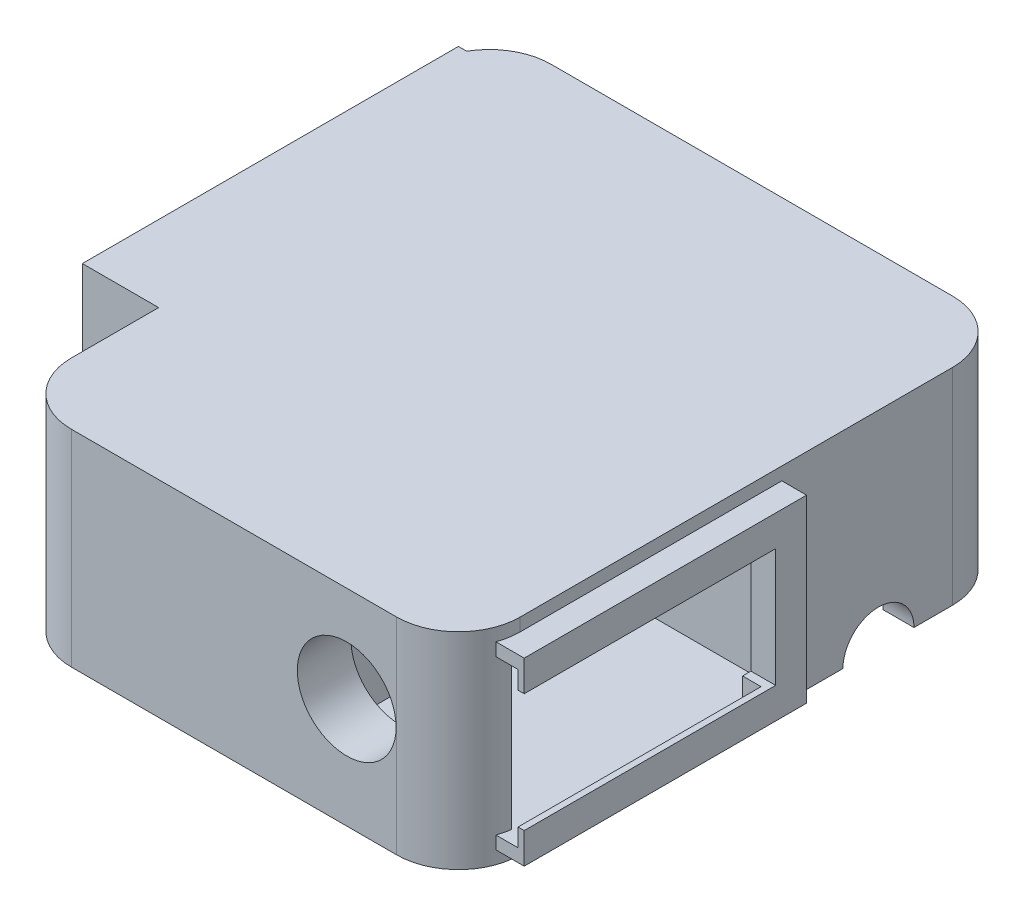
ISO-10303-21;
HEADER;
FILE_DESCRIPTION(('STEP AP214'),'2;1');
FILE_NAME('part.step','',(''),(''),'','','');
FILE_SCHEMA(('AUTOMOTIVE_DESIGN { 1 0 10303 214 1 1 1 1 }'));
ENDSEC;
DATA;
#1=APPLICATION_CONTEXT('core data for automotive mechanical design processes');
#2=APPLICATION_PROTOCOL_DEFINITION('international standard','automotive_design',2000,#1);
#3=PRODUCT_CONTEXT('',#1,'mechanical');
#4=PRODUCT('Part','Part','',(#3));
#5=PRODUCT_RELATED_PRODUCT_CATEGORY('part','',(#4));
#6=PRODUCT_DEFINITION_FORMATION('','',#4);
#7=PRODUCT_DEFINITION_CONTEXT('part definition',#1,'design');
#8=PRODUCT_DEFINITION('design','',#6,#7);
#9=PRODUCT_DEFINITION_SHAPE('','',#8);
#10=(LENGTH_UNIT() NAMED_UNIT(*) SI_UNIT(.MILLI.,.METRE.));
#11=(NAMED_UNIT(*) PLANE_ANGLE_UNIT() SI_UNIT($,.RADIAN.));
#12=(NAMED_UNIT(*) SI_UNIT($,.STERADIAN.) SOLID_ANGLE_UNIT());
#13=UNCERTAINTY_MEASURE_WITH_UNIT(LENGTH_MEASURE(1.E-05),#10,'distance_accuracy_value','');
#14=(GEOMETRIC_REPRESENTATION_CONTEXT(3) GLOBAL_UNCERTAINTY_ASSIGNED_CONTEXT((#13)) GLOBAL_UNIT_ASSIGNED_CONTEXT((#10,
#11,#12)) REPRESENTATION_CONTEXT('',''));
#15=CARTESIAN_POINT('',(0.,0.,0.));
#16=DIRECTION('',(0.,0.,1.));
#17=DIRECTION('',(1.,0.,0.));
#18=AXIS2_PLACEMENT_3D('',#15,#16,#17);
#19=CARTESIAN_POINT('',(-42.5,166.65,-18.));
#20=DIRECTION('',(1.,0.,0.));
#21=DIRECTION('',(0.,0.,-1.));
#22=AXIS2_PLACEMENT_3D('',#19,#20,#21);
#23=CYLINDRICAL_SURFACE('',#22,10.3);
#24=CARTESIAN_POINT('',(-30.77,166.65,-18.));
#25=DIRECTION('',(-1.,0.,0.));
#26=DIRECTION('',(0.,0.,-1.));
#27=AXIS2_PLACEMENT_3D('',#24,#25,#26);
#28=CIRCLE('',#27,10.3);
#29=CARTESIAN_POINT('',(-30.77,166.65,-7.7));
#30=VERTEX_POINT('',#29);
#31=CARTESIAN_POINT('',(-30.77,166.65,-28.3));
#32=VERTEX_POINT('',#31);
#33=EDGE_CURVE('E1114',#30,#32,#28,.T.);
#34=ORIENTED_EDGE('',*,*,#33,.F.);
#35=DIRECTION('',(1.,0.,0.));
#36=VECTOR('',#35,1.);
#37=CARTESIAN_POINT('',(-52.77,166.65,-7.7));
#38=LINE('',#37,#36);
#39=CARTESIAN_POINT('',(-42.5,166.65,-7.7));
#40=VERTEX_POINT('',#39);
#41=EDGE_CURVE('E694',#40,#30,#38,.T.);
#42=ORIENTED_EDGE('',*,*,#41,.F.);
#43=CARTESIAN_POINT('',(-42.5,166.65,-18.));
#44=DIRECTION('',(-1.,0.,0.));
#45=DIRECTION('',(0.,0.,-1.));
#46=AXIS2_PLACEMENT_3D('',#43,#44,#45);
#47=CIRCLE('',#46,10.3);
#48=CARTESIAN_POINT('',(-42.5,166.65,-28.3));
#49=VERTEX_POINT('',#48);
#50=EDGE_CURVE('E971',#40,#49,#47,.T.);
#51=ORIENTED_EDGE('',*,*,#50,.T.);
#52=DIRECTION('',(1.,0.,0.));
#53=VECTOR('',#52,1.);
#54=CARTESIAN_POINT('',(-42.5,166.65,-28.3));
#55=LINE('',#54,#53);
#56=EDGE_CURVE('E976',#49,#32,#55,.T.);
#57=ORIENTED_EDGE('',*,*,#56,.T.);
#58=EDGE_LOOP('',(#34,#42,#51,#57));
#59=FACE_BOUND('',#58,.T.);
#60=ADVANCED_FACE('F284',(#59),#23,.F.);
#61=CARTESIAN_POINT('',(-32.5,166.65,-30.));
#62=DIRECTION('',(0.,1.,0.));
#63=DIRECTION('',(0.,0.,-1.));
#64=AXIS2_PLACEMENT_3D('',#61,#62,#63);
#65=CYLINDRICAL_SURFACE('',#64,10.);
#66=CARTESIAN_POINT('',(-32.5,166.65,-30.));
#67=DIRECTION('',(0.,-1.,0.));
#68=DIRECTION('',(0.,0.,-1.));
#69=AXIS2_PLACEMENT_3D('',#66,#67,#68);
#70=CIRCLE('',#69,10.);
#71=CARTESIAN_POINT('',(-32.5,166.65,-40.));
#72=VERTEX_POINT('',#71);
#73=CARTESIAN_POINT('',(-41.1602540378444,166.65,-35.));
#74=VERTEX_POINT('',#73);
#75=EDGE_CURVE('E305',#72,#74,#70,.F.);
#76=ORIENTED_EDGE('',*,*,#75,.T.);
#77=DIRECTION('',(0.,1.,0.));
#78=VECTOR('',#77,1.);
#79=CARTESIAN_POINT('',(-41.1602540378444,166.65,-35.));
#80=LINE('',#79,#78);
#81=CARTESIAN_POINT('',(-41.1602540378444,200.,-35.));
#82=VERTEX_POINT('',#81);
#83=EDGE_CURVE('E300',#74,#82,#80,.T.);
#84=ORIENTED_EDGE('',*,*,#83,.T.);
#85=CARTESIAN_POINT('',(-32.5,200.,-30.));
#86=DIRECTION('',(0.,-1.,0.));
#87=DIRECTION('',(0.,0.,-1.));
#88=AXIS2_PLACEMENT_3D('',#85,#86,#87);
#89=CIRCLE('',#88,10.);
#90=CARTESIAN_POINT('',(-32.5,200.,-40.));
#91=VERTEX_POINT('',#90);
#92=EDGE_CURVE('E1119',#82,#91,#89,.T.);
#93=ORIENTED_EDGE('',*,*,#92,.T.);
#94=DIRECTION('',(0.,1.,0.));
#95=VECTOR('',#94,1.);
#96=CARTESIAN_POINT('',(-32.5,166.65,-40.));
#97=LINE('',#96,#95);
#98=EDGE_CURVE('E1124',#91,#72,#97,.F.);
#99=ORIENTED_EDGE('',*,*,#98,.T.);
#100=EDGE_LOOP('',(#76,#84,#93,#99));
#101=FACE_BOUND('',#100,.T.);
#102=ADVANCED_FACE('F1347',(#101),#65,.T.);
#103=CARTESIAN_POINT('',(32.5,166.65,40.));
#104=DIRECTION('',(0.,-1.,0.));
#105=DIRECTION('',(0.,0.,-1.));
#106=AXIS2_PLACEMENT_3D('',#103,#104,#105);
#107=CYLINDRICAL_SURFACE('',#106,10.);
#108=DIRECTION('',(0.,-1.,0.));
#109=VECTOR('',#108,1.);
#110=CARTESIAN_POINT('',(42.4130431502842,166.65,41.3158934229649));
#111=LINE('',#110,#109);
#112=CARTESIAN_POINT('',(42.4130431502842,195.825,41.3158934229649));
#113=VERTEX_POINT('',#112);
#114=CARTESIAN_POINT('',(42.4130431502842,170.825,41.3158934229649));
#115=VERTEX_POINT('',#114);
#116=EDGE_CURVE('E1171',#113,#115,#111,.T.);
#117=ORIENTED_EDGE('',*,*,#116,.F.);
#118=CARTESIAN_POINT('',(32.5,195.825,40.));
#119=DIRECTION('',(0.,1.,0.));
#120=DIRECTION('',(0.,0.,1.));
#121=AXIS2_PLACEMENT_3D('',#118,#119,#120);
#122=CIRCLE('',#121,10.);
#123=CARTESIAN_POINT('',(41.9222460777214,195.825,43.3498177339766));
#124=VERTEX_POINT('',#123);
#125=EDGE_CURVE('E735',#113,#124,#122,.F.);
#126=ORIENTED_EDGE('',*,*,#125,.T.);
#127=DIRECTION('',(0.,-1.,0.));
#128=VECTOR('',#127,1.);
#129=CARTESIAN_POINT('',(41.9222460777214,166.65,43.3498177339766));
#130=LINE('',#129,#128);
#131=CARTESIAN_POINT('',(41.9222460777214,197.9125,43.3498177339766));
#132=VERTEX_POINT('',#131);
#133=EDGE_CURVE('E732',#124,#132,#130,.F.);
#134=ORIENTED_EDGE('',*,*,#133,.T.);
#135=CARTESIAN_POINT('',(32.5,197.9125,40.));
#136=DIRECTION('',(0.,-1.,0.));
#137=DIRECTION('',(0.,0.,-1.));
#138=AXIS2_PLACEMENT_3D('',#135,#136,#137);
#139=CIRCLE('',#138,10.);
#140=CARTESIAN_POINT('',(42.5,197.9125,40.));
#141=VERTEX_POINT('',#140);
#142=EDGE_CURVE('E730',#132,#141,#139,.F.);
#143=ORIENTED_EDGE('',*,*,#142,.T.);
#144=DIRECTION('',(0.,-1.,0.));
#145=VECTOR('',#144,1.);
#146=CARTESIAN_POINT('',(42.5,166.65,40.));
#147=LINE('',#146,#145);
#148=CARTESIAN_POINT('',(42.5,200.,40.));
#149=VERTEX_POINT('',#148);
#150=EDGE_CURVE('E1134',#149,#141,#147,.T.);
#151=ORIENTED_EDGE('',*,*,#150,.F.);
#152=CARTESIAN_POINT('',(32.5,200.,40.));
#153=DIRECTION('',(0.,1.,0.));
#154=DIRECTION('',(0.,0.,1.));
#155=AXIS2_PLACEMENT_3D('',#152,#153,#154);
#156=CIRCLE('',#155,10.);
#157=CARTESIAN_POINT('',(32.5,200.,50.));
#158=VERTEX_POINT('',#157);
#159=EDGE_CURVE('E1142',#158,#149,#156,.T.);
#160=ORIENTED_EDGE('',*,*,#159,.F.);
#161=DIRECTION('',(0.,-1.,0.));
#162=VECTOR('',#161,1.);
#163=CARTESIAN_POINT('',(32.5,0.,50.));
#164=LINE('',#163,#162);
#165=CARTESIAN_POINT('',(32.5,166.65,50.));
#166=VERTEX_POINT('',#165);
#167=EDGE_CURVE('E1139',#166,#158,#164,.F.);
#168=ORIENTED_EDGE('',*,*,#167,.F.);
#169=CARTESIAN_POINT('',(32.5,166.65,40.));
#170=DIRECTION('',(0.,1.,0.));
#171=DIRECTION('',(0.,0.,1.));
#172=AXIS2_PLACEMENT_3D('',#169,#170,#171);
#173=CIRCLE('',#172,10.);
#174=CARTESIAN_POINT('',(42.5,166.65,40.));
#175=VERTEX_POINT('',#174);
#176=EDGE_CURVE('E1137',#175,#166,#173,.F.);
#177=ORIENTED_EDGE('',*,*,#176,.F.);
#178=CARTESIAN_POINT('',(42.5,168.7375,40.));
#179=VERTEX_POINT('',#178);
#180=EDGE_CURVE('E1133',#179,#175,#147,.T.);
#181=ORIENTED_EDGE('',*,*,#180,.F.);
#182=CARTESIAN_POINT('',(32.5,168.7375,40.));
#183=DIRECTION('',(0.,1.,0.));
#184=DIRECTION('',(0.,0.,1.));
#185=AXIS2_PLACEMENT_3D('',#182,#183,#184);
#186=CIRCLE('',#185,10.);
#187=CARTESIAN_POINT('',(41.9222460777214,168.7375,43.3498177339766));
#188=VERTEX_POINT('',#187);
#189=EDGE_CURVE('E758',#179,#188,#186,.F.);
#190=ORIENTED_EDGE('',*,*,#189,.T.);
#191=DIRECTION('',(0.,-1.,0.));
#192=VECTOR('',#191,1.);
#193=CARTESIAN_POINT('',(41.9222460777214,166.65,43.3498177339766));
#194=LINE('',#193,#192);
#195=CARTESIAN_POINT('',(41.9222460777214,170.825,43.3498177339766));
#196=VERTEX_POINT('',#195);
#197=EDGE_CURVE('E755',#188,#196,#194,.F.);
#198=ORIENTED_EDGE('',*,*,#197,.T.);
#199=CARTESIAN_POINT('',(32.5,170.825,40.));
#200=DIRECTION('',(0.,-1.,0.));
#201=DIRECTION('',(0.,0.,-1.));
#202=AXIS2_PLACEMENT_3D('',#199,#200,#201);
#203=CIRCLE('',#202,10.);
#204=EDGE_CURVE('E752',#196,#115,#203,.F.);
#205=ORIENTED_EDGE('',*,*,#204,.T.);
#206=EDGE_LOOP('',(#117,#126,#134,#143,#151,#160,#168,#177,#181,#190,#198,#205));
#207=FACE_BOUND('',#206,.T.);
#208=ADVANCED_FACE('F1206',(#207),#107,.T.);
#209=CARTESIAN_POINT('',(45.5,195.825,4.));
#210=DIRECTION('',(-1.,0.,0.));
#211=DIRECTION('',(0.,0.,1.));
#212=AXIS2_PLACEMENT_3D('',#209,#210,#211);
#213=PLANE('',#212);
#214=DIRECTION('',(0.,-1.,0.));
#215=VECTOR('',#214,1.);
#216=CARTESIAN_POINT('',(45.5,197.9125,43.3498177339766));
#217=LINE('',#216,#215);
#218=CARTESIAN_POINT('',(45.5,195.825,43.3498177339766));
#219=VERTEX_POINT('',#218);
#220=CARTESIAN_POINT('',(45.5,192.9125,43.3498177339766));
#221=VERTEX_POINT('',#220);
#222=EDGE_CURVE('E739',#219,#221,#217,.T.);
#223=ORIENTED_EDGE('',*,*,#222,.F.);
#224=DIRECTION('',(0.,0.,1.));
#225=VECTOR('',#224,1.);
#226=CARTESIAN_POINT('',(45.5,195.825,4.));
#227=LINE('',#226,#225);
#228=CARTESIAN_POINT('',(45.5,195.825,4.));
#229=VERTEX_POINT('',#228);
#230=EDGE_CURVE('E785',#229,#219,#227,.T.);
#231=ORIENTED_EDGE('',*,*,#230,.F.);
#232=DIRECTION('',(0.,-1.,0.));
#233=VECTOR('',#232,1.);
#234=CARTESIAN_POINT('',(45.5,195.825,4.));
#235=LINE('',#234,#233);
#236=CARTESIAN_POINT('',(45.5,192.9125,4.));
#237=VERTEX_POINT('',#236);
#238=EDGE_CURVE('E774',#229,#237,#235,.T.);
#239=ORIENTED_EDGE('',*,*,#238,.T.);
#240=DIRECTION('',(0.,0.,1.));
#241=VECTOR('',#240,1.);
#242=CARTESIAN_POINT('',(45.5,192.9125,40.));
#243=LINE('',#242,#241);
#244=EDGE_CURVE('E12',#237,#221,#243,.T.);
#245=ORIENTED_EDGE('',*,*,#244,.T.);
#246=EDGE_LOOP('',(#223,#231,#239,#245));
#247=FACE_BOUND('',#246,.T.);
#248=ADVANCED_FACE('F1185',(#247),#213,.T.);
#249=DIRECTION('',(0.,0.,1.));
#250=VECTOR('',#249,1.);
#251=CARTESIAN_POINT('',(45.5,170.825,4.));
#252=LINE('',#251,#250);
#253=CARTESIAN_POINT('',(45.5,170.825,4.));
#254=VERTEX_POINT('',#253);
#255=CARTESIAN_POINT('',(45.5,170.825,43.3498177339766));
#256=VERTEX_POINT('',#255);
#257=EDGE_CURVE('E787',#254,#256,#252,.T.);
#258=ORIENTED_EDGE('',*,*,#257,.T.);
#259=DIRECTION('',(0.,-1.,0.));
#260=VECTOR('',#259,1.);
#261=CARTESIAN_POINT('',(45.5,173.7375,43.3498177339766));
#262=LINE('',#261,#260);
#263=CARTESIAN_POINT('',(45.5,173.7375,43.3498177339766));
#264=VERTEX_POINT('',#263);
#265=EDGE_CURVE('E762',#264,#256,#262,.T.);
#266=ORIENTED_EDGE('',*,*,#265,.F.);
#267=DIRECTION('',(0.,0.,-1.));
#268=VECTOR('',#267,1.);
#269=CARTESIAN_POINT('',(45.5,173.7375,40.));
#270=LINE('',#269,#268);
#271=CARTESIAN_POINT('',(45.5,173.7375,4.));
#272=VERTEX_POINT('',#271);
#273=EDGE_CURVE('E791',#264,#272,#270,.T.);
#274=ORIENTED_EDGE('',*,*,#273,.T.);
#275=EDGE_CURVE('E771',#272,#254,#235,.T.);
#276=ORIENTED_EDGE('',*,*,#275,.T.);
#277=EDGE_LOOP('',(#258,#266,#274,#276));
#278=FACE_BOUND('',#277,.T.);
#279=ADVANCED_FACE('F1561',(#278),#213,.T.);
#280=CARTESIAN_POINT('',(42.5,0.,0.));
#281=DIRECTION('',(1.,0.,0.));
#282=DIRECTION('',(0.,0.,-1.));
#283=AXIS2_PLACEMENT_3D('',#280,#281,#282);
#284=PLANE('',#283);
#285=DIRECTION('',(0.,-1.,0.));
#286=VECTOR('',#285,1.);
#287=CARTESIAN_POINT('',(42.5,195.825,4.));
#288=LINE('',#287,#286);
#289=CARTESIAN_POINT('',(42.5,195.825,4.));
#290=VERTEX_POINT('',#289);
#291=CARTESIAN_POINT('',(42.5,192.9125,4.));
#292=VERTEX_POINT('',#291);
#293=EDGE_CURVE('E781',#290,#292,#288,.T.);
#294=ORIENTED_EDGE('',*,*,#293,.F.);
#295=DIRECTION('',(0.,0.,1.));
#296=VECTOR('',#295,1.);
#297=CARTESIAN_POINT('',(42.5,195.825,0.0658934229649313));
#298=LINE('',#297,#296);
#299=CARTESIAN_POINT('',(42.5,195.825,0.0658934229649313));
#300=VERTEX_POINT('',#299);
#301=EDGE_CURVE('E850',#300,#290,#298,.T.);
#302=ORIENTED_EDGE('',*,*,#301,.F.);
#303=DIRECTION('',(0.,1.,0.));
#304=VECTOR('',#303,1.);
#305=CARTESIAN_POINT('',(42.5,170.825,0.0658934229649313));
#306=LINE('',#305,#304);
#307=CARTESIAN_POINT('',(42.5,170.825,0.0658934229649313));
#308=VERTEX_POINT('',#307);
#309=EDGE_CURVE('E833',#308,#300,#306,.T.);
#310=ORIENTED_EDGE('',*,*,#309,.F.);
#311=DIRECTION('',(0.,0.,-1.));
#312=VECTOR('',#311,1.);
#313=CARTESIAN_POINT('',(42.5,170.825,0.0658934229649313));
#314=LINE('',#313,#312);
#315=CARTESIAN_POINT('',(42.5,170.825,4.));
#316=VERTEX_POINT('',#315);
#317=EDGE_CURVE('E838',#316,#308,#314,.T.);
#318=ORIENTED_EDGE('',*,*,#317,.F.);
#319=CARTESIAN_POINT('',(42.5,173.7375,4.));
#320=VERTEX_POINT('',#319);
#321=EDGE_CURVE('E780',#320,#316,#288,.T.);
#322=ORIENTED_EDGE('',*,*,#321,.F.);
#323=DIRECTION('',(0.,0.,-1.));
#324=VECTOR('',#323,1.);
#325=CARTESIAN_POINT('',(42.5,173.7375,40.));
#326=LINE('',#325,#324);
#327=CARTESIAN_POINT('',(42.5,173.7375,2.64406631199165));
#328=VERTEX_POINT('',#327);
#329=EDGE_CURVE('E793',#328,#320,#326,.F.);
#330=ORIENTED_EDGE('',*,*,#329,.F.);
#331=DIRECTION('',(0.,1.,0.));
#332=VECTOR('',#331,1.);
#333=CARTESIAN_POINT('',(42.5,197.9125,2.64406631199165));
#334=LINE('',#333,#332);
#335=CARTESIAN_POINT('',(42.5,192.9125,2.64406631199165));
#336=VERTEX_POINT('',#335);
#337=EDGE_CURVE('E797',#336,#328,#334,.F.);
#338=ORIENTED_EDGE('',*,*,#337,.F.);
#339=DIRECTION('',(0.,0.,-1.));
#340=VECTOR('',#339,1.);
#341=CARTESIAN_POINT('',(42.5,192.9125,40.));
#342=LINE('',#341,#340);
#343=EDGE_CURVE('E821',#292,#336,#342,.T.);
#344=ORIENTED_EDGE('',*,*,#343,.F.);
#345=EDGE_LOOP('',(#294,#302,#310,#318,#322,#330,#338,#344));
#346=FACE_BOUND('',#345,.T.);
#347=ADVANCED_FACE('F1220',(#346),#284,.F.);
#348=CARTESIAN_POINT('',(46.5,173.7375,40.));
#349=DIRECTION('',(0.,-1.,0.));
#350=DIRECTION('',(0.,0.,-1.));
#351=AXIS2_PLACEMENT_3D('',#348,#349,#350);
#352=PLANE('',#351);
#353=ORIENTED_EDGE('',*,*,#273,.F.);
#354=DIRECTION('',(1.,0.,0.));
#355=VECTOR('',#354,1.);
#356=CARTESIAN_POINT('',(45.5,173.7375,43.3498177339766));
#357=LINE('',#356,#355);
#358=CARTESIAN_POINT('',(46.5,173.7375,43.3498177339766));
#359=VERTEX_POINT('',#358);
#360=EDGE_CURVE('E765',#264,#359,#357,.T.);
#361=ORIENTED_EDGE('',*,*,#360,.T.);
#362=DIRECTION('',(0.,0.,-1.));
#363=VECTOR('',#362,1.);
#364=CARTESIAN_POINT('',(46.5,173.7375,40.));
#365=LINE('',#364,#363);
#366=CARTESIAN_POINT('',(46.5,173.7375,2.64406631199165));
#367=VERTEX_POINT('',#366);
#368=EDGE_CURVE('E794',#367,#359,#365,.F.);
#369=ORIENTED_EDGE('',*,*,#368,.F.);
#370=DIRECTION('',(-1.,0.,0.));
#371=VECTOR('',#370,1.);
#372=CARTESIAN_POINT('',(46.5,173.7375,2.64406631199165));
#373=LINE('',#372,#371);
#374=EDGE_CURVE('E809',#367,#328,#373,.T.);
#375=ORIENTED_EDGE('',*,*,#374,.T.);
#376=ORIENTED_EDGE('',*,*,#329,.T.);
#377=DIRECTION('',(-1.,0.,0.));
#378=VECTOR('',#377,1.);
#379=CARTESIAN_POINT('',(46.5,173.7375,4.));
#380=LINE('',#379,#378);
#381=EDGE_CURVE('E789',#272,#320,#380,.T.);
#382=ORIENTED_EDGE('',*,*,#381,.F.);
#383=EDGE_LOOP('',(#353,#361,#369,#375,#376,#382));
#384=FACE_BOUND('',#383,.T.);
#385=ADVANCED_FACE('F1232',(#384),#352,.F.);
#386=CARTESIAN_POINT('',(46.5,192.9125,40.));
#387=DIRECTION('',(0.,1.,0.));
#388=DIRECTION('',(0.,0.,1.));
#389=AXIS2_PLACEMENT_3D('',#386,#387,#388);
#390=PLANE('',#389);
#391=ORIENTED_EDGE('',*,*,#244,.F.);
#392=DIRECTION('',(1.,0.,0.));
#393=VECTOR('',#392,1.);
#394=CARTESIAN_POINT('',(46.5,192.9125,4.));
#395=LINE('',#394,#393);
#396=EDGE_CURVE('E293',#292,#237,#395,.T.);
#397=ORIENTED_EDGE('',*,*,#396,.F.);
#398=ORIENTED_EDGE('',*,*,#343,.T.);
#399=DIRECTION('',(-1.,0.,0.));
#400=VECTOR('',#399,1.);
#401=CARTESIAN_POINT('',(46.5,192.9125,2.64406631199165));
#402=LINE('',#401,#400);
#403=CARTESIAN_POINT('',(46.5,192.9125,2.64406631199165));
#404=VERTEX_POINT('',#403);
#405=EDGE_CURVE('E826',#404,#336,#402,.T.);
#406=ORIENTED_EDGE('',*,*,#405,.F.);
#407=DIRECTION('',(0.,0.,-1.));
#408=VECTOR('',#407,1.);
#409=CARTESIAN_POINT('',(46.5,192.9125,40.));
#410=LINE('',#409,#408);
#411=CARTESIAN_POINT('',(46.5,192.9125,43.3498177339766));
#412=VERTEX_POINT('',#411);
#413=EDGE_CURVE('E805',#412,#404,#410,.T.);
#414=ORIENTED_EDGE('',*,*,#413,.F.);
#415=DIRECTION('',(1.,0.,0.));
#416=VECTOR('',#415,1.);
#417=CARTESIAN_POINT('',(45.5,192.9125,43.3498177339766));
#418=LINE('',#417,#416);
#419=EDGE_CURVE('E744',#221,#412,#418,.T.);
#420=ORIENTED_EDGE('',*,*,#419,.F.);
#421=EDGE_LOOP('',(#391,#397,#398,#406,#414,#420));
#422=FACE_BOUND('',#421,.T.);
#423=ADVANCED_FACE('F1187',(#422),#390,.F.);
#424=CARTESIAN_POINT('',(-11.315,194.965,25.77));
#425=DIRECTION('',(0.,0.,1.));
#426=DIRECTION('',(1.,0.,0.));
#427=AXIS2_PLACEMENT_3D('',#424,#425,#426);
#428=PLANE('',#427);
#429=DIRECTION('',(0.,1.,0.));
#430=VECTOR('',#429,1.);
#431=CARTESIAN_POINT('',(14.,194.965,25.77));
#432=LINE('',#431,#430);
#433=CARTESIAN_POINT('',(14.,191.465,25.77));
#434=VERTEX_POINT('',#433);
#435=CARTESIAN_POINT('',(14.,194.965,25.77));
#436=VERTEX_POINT('',#435);
#437=EDGE_CURVE('E865',#434,#436,#432,.T.);
#438=ORIENTED_EDGE('',*,*,#437,.F.);
#439=DIRECTION('',(-1.,0.,0.));
#440=VECTOR('',#439,1.);
#441=CARTESIAN_POINT('',(20.685,191.465,25.77));
#442=LINE('',#441,#440);
#443=CARTESIAN_POINT('',(3.73500000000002,191.465,25.77));
#444=VERTEX_POINT('',#443);
#445=EDGE_CURVE('E904',#434,#444,#442,.T.);
#446=ORIENTED_EDGE('',*,*,#445,.T.);
#447=DIRECTION('',(0.,-1.,0.));
#448=VECTOR('',#447,1.);
#449=CARTESIAN_POINT('',(3.73500000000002,194.965,25.77));
#450=LINE('',#449,#448);
#451=CARTESIAN_POINT('',(3.73500000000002,184.965,25.77));
#452=VERTEX_POINT('',#451);
#453=EDGE_CURVE('E921',#444,#452,#450,.T.);
#454=ORIENTED_EDGE('',*,*,#453,.T.);
#455=DIRECTION('',(-1.,0.,0.));
#456=VECTOR('',#455,1.);
#457=CARTESIAN_POINT('',(3.73500000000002,184.965,25.77));
#458=LINE('',#457,#456);
#459=CARTESIAN_POINT('',(-2.61499999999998,184.965,25.77));
#460=VERTEX_POINT('',#459);
#461=EDGE_CURVE('E923',#452,#460,#458,.T.);
#462=ORIENTED_EDGE('',*,*,#461,.T.);
#463=DIRECTION('',(0.,-1.,0.));
#464=VECTOR('',#463,1.);
#465=CARTESIAN_POINT('',(-2.61499999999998,194.965,25.77));
#466=LINE('',#465,#464);
#467=CARTESIAN_POINT('',(-2.61499999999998,191.465,25.77));
#468=VERTEX_POINT('',#467);
#469=EDGE_CURVE('E919',#468,#460,#466,.T.);
#470=ORIENTED_EDGE('',*,*,#469,.F.);
#471=CARTESIAN_POINT('',(-11.315,191.465,25.77));
#472=VERTEX_POINT('',#471);
#473=EDGE_CURVE('E907',#468,#472,#442,.T.);
#474=ORIENTED_EDGE('',*,*,#473,.T.);
#475=DIRECTION('',(0.,-1.,0.));
#476=VECTOR('',#475,1.);
#477=CARTESIAN_POINT('',(-11.315,194.965,25.77));
#478=LINE('',#477,#476);
#479=CARTESIAN_POINT('',(-11.315,184.965,25.77));
#480=VERTEX_POINT('',#479);
#481=EDGE_CURVE('E956',#472,#480,#478,.T.);
#482=ORIENTED_EDGE('',*,*,#481,.T.);
#483=DIRECTION('',(-1.,0.,0.));
#484=VECTOR('',#483,1.);
#485=CARTESIAN_POINT('',(-11.315,184.965,25.77));
#486=LINE('',#485,#484);
#487=CARTESIAN_POINT('',(-17.665,184.965,25.77));
#488=VERTEX_POINT('',#487);
#489=EDGE_CURVE('E940',#480,#488,#486,.T.);
#490=ORIENTED_EDGE('',*,*,#489,.T.);
#491=DIRECTION('',(0.,-1.,0.));
#492=VECTOR('',#491,1.);
#493=CARTESIAN_POINT('',(-17.665,194.965,25.77));
#494=LINE('',#493,#492);
#495=CARTESIAN_POINT('',(-17.665,193.965,25.77));
#496=VERTEX_POINT('',#495);
#497=EDGE_CURVE('E953',#496,#488,#494,.T.);
#498=ORIENTED_EDGE('',*,*,#497,.F.);
#499=CARTESIAN_POINT('',(-16.665,193.965,25.77));
#500=DIRECTION('',(0.,0.,1.));
#501=DIRECTION('',(1.,0.,0.));
#502=AXIS2_PLACEMENT_3D('',#499,#500,#501);
#503=CIRCLE('',#502,1.);
#504=CARTESIAN_POINT('',(-16.665,194.965,25.77));
#505=VERTEX_POINT('',#504);
#506=EDGE_CURVE('E1151',#496,#505,#503,.F.);
#507=ORIENTED_EDGE('',*,*,#506,.T.);
#508=DIRECTION('',(-1.,0.,0.));
#509=VECTOR('',#508,1.);
#510=CARTESIAN_POINT('',(-11.315,194.965,25.77));
#511=LINE('',#510,#509);
#512=EDGE_CURVE('E939',#436,#505,#511,.T.);
#513=ORIENTED_EDGE('',*,*,#512,.F.);
#514=EDGE_LOOP('',(#438,#446,#454,#462,#470,#474,#482,#490,#498,#507,#513));
#515=FACE_BOUND('',#514,.T.);
#516=ADVANCED_FACE('F1506',(#515),#428,.F.);
#517=CARTESIAN_POINT('',(-17.665,194.965,20.77));
#518=DIRECTION('',(0.,0.,-1.));
#519=DIRECTION('',(-1.,0.,0.));
#520=AXIS2_PLACEMENT_3D('',#517,#518,#519);
#521=PLANE('',#520);
#522=DIRECTION('',(0.,-1.,0.));
#523=VECTOR('',#522,1.);
#524=CARTESIAN_POINT('',(14.,194.965,20.77));
#525=LINE('',#524,#523);
#526=CARTESIAN_POINT('',(14.,194.965,20.77));
#527=VERTEX_POINT('',#526);
#528=CARTESIAN_POINT('',(14.,191.465,20.77));
#529=VERTEX_POINT('',#528);
#530=EDGE_CURVE('E857',#527,#529,#525,.T.);
#531=ORIENTED_EDGE('',*,*,#530,.F.);
#532=DIRECTION('',(1.,0.,0.));
#533=VECTOR('',#532,1.);
#534=CARTESIAN_POINT('',(-17.665,194.965,20.77));
#535=LINE('',#534,#533);
#536=CARTESIAN_POINT('',(-16.665,194.965,20.77));
#537=VERTEX_POINT('',#536);
#538=EDGE_CURVE('E936',#537,#527,#535,.T.);
#539=ORIENTED_EDGE('',*,*,#538,.F.);
#540=CARTESIAN_POINT('',(-16.665,193.965,20.77));
#541=DIRECTION('',(0.,0.,-1.));
#542=DIRECTION('',(-1.,0.,0.));
#543=AXIS2_PLACEMENT_3D('',#540,#541,#542);
#544=CIRCLE('',#543,1.);
#545=CARTESIAN_POINT('',(-17.665,193.965,20.77));
#546=VERTEX_POINT('',#545);
#547=EDGE_CURVE('E1147',#537,#546,#544,.F.);
#548=ORIENTED_EDGE('',*,*,#547,.T.);
#549=DIRECTION('',(0.,-1.,0.));
#550=VECTOR('',#549,1.);
#551=CARTESIAN_POINT('',(-17.665,194.965,20.77));
#552=LINE('',#551,#550);
#553=CARTESIAN_POINT('',(-17.665,184.965,20.77));
#554=VERTEX_POINT('',#553);
#555=EDGE_CURVE('E942',#546,#554,#552,.T.);
#556=ORIENTED_EDGE('',*,*,#555,.T.);
#557=DIRECTION('',(1.,0.,0.));
#558=VECTOR('',#557,1.);
#559=CARTESIAN_POINT('',(-17.665,184.965,20.77));
#560=LINE('',#559,#558);
#561=CARTESIAN_POINT('',(-11.315,184.965,20.77));
#562=VERTEX_POINT('',#561);
#563=EDGE_CURVE('E945',#554,#562,#560,.T.);
#564=ORIENTED_EDGE('',*,*,#563,.T.);
#565=DIRECTION('',(0.,-1.,0.));
#566=VECTOR('',#565,1.);
#567=CARTESIAN_POINT('',(-11.315,194.965,20.77));
#568=LINE('',#567,#566);
#569=CARTESIAN_POINT('',(-11.315,191.465,20.77));
#570=VERTEX_POINT('',#569);
#571=EDGE_CURVE('E958',#570,#562,#568,.T.);
#572=ORIENTED_EDGE('',*,*,#571,.F.);
#573=DIRECTION('',(-1.,0.,0.));
#574=VECTOR('',#573,1.);
#575=CARTESIAN_POINT('',(20.685,191.465,20.77));
#576=LINE('',#575,#574);
#577=CARTESIAN_POINT('',(-2.61499999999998,191.465,20.77));
#578=VERTEX_POINT('',#577);
#579=EDGE_CURVE('E903',#578,#570,#576,.T.);
#580=ORIENTED_EDGE('',*,*,#579,.F.);
#581=DIRECTION('',(0.,-1.,0.));
#582=VECTOR('',#581,1.);
#583=CARTESIAN_POINT('',(-2.61499999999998,194.965,20.77));
#584=LINE('',#583,#582);
#585=CARTESIAN_POINT('',(-2.61499999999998,184.965,20.77));
#586=VERTEX_POINT('',#585);
#587=EDGE_CURVE('E917',#578,#586,#584,.T.);
#588=ORIENTED_EDGE('',*,*,#587,.T.);
#589=DIRECTION('',(-1.,0.,0.));
#590=VECTOR('',#589,1.);
#591=CARTESIAN_POINT('',(3.73500000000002,184.965,20.77));
#592=LINE('',#591,#590);
#593=CARTESIAN_POINT('',(3.73500000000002,184.965,20.77));
#594=VERTEX_POINT('',#593);
#595=EDGE_CURVE('E929',#594,#586,#592,.T.);
#596=ORIENTED_EDGE('',*,*,#595,.F.);
#597=DIRECTION('',(0.,-1.,0.));
#598=VECTOR('',#597,1.);
#599=CARTESIAN_POINT('',(3.73500000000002,194.965,20.77));
#600=LINE('',#599,#598);
#601=CARTESIAN_POINT('',(3.73500000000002,191.465,20.77));
#602=VERTEX_POINT('',#601);
#603=EDGE_CURVE('E915',#602,#594,#600,.T.);
#604=ORIENTED_EDGE('',*,*,#603,.F.);
#605=EDGE_CURVE('E908',#529,#602,#576,.T.);
#606=ORIENTED_EDGE('',*,*,#605,.F.);
#607=EDGE_LOOP('',(#531,#539,#548,#556,#564,#572,#580,#588,#596,#604,#606));
#608=FACE_BOUND('',#607,.T.);
#609=ADVANCED_FACE('F1504',(#608),#521,.F.);
#610=CARTESIAN_POINT('',(0.,194.965,0.));
#611=DIRECTION('',(0.,-1.,0.));
#612=DIRECTION('',(0.,0.,-1.));
#613=AXIS2_PLACEMENT_3D('',#610,#611,#612);
#614=PLANE('',#613);
#615=ORIENTED_EDGE('',*,*,#538,.T.);
#616=DIRECTION('',(0.,0.,1.));
#617=VECTOR('',#616,1.);
#618=CARTESIAN_POINT('',(14.,194.965,0.));
#619=LINE('',#618,#617);
#620=EDGE_CURVE('E867',#527,#436,#619,.T.);
#621=ORIENTED_EDGE('',*,*,#620,.T.);
#622=ORIENTED_EDGE('',*,*,#512,.T.);
#623=DIRECTION('',(0.,0.,-1.));
#624=VECTOR('',#623,1.);
#625=CARTESIAN_POINT('',(-16.665,194.965,0.));
#626=LINE('',#625,#624);
#627=EDGE_CURVE('E1144',#505,#537,#626,.T.);
#628=ORIENTED_EDGE('',*,*,#627,.T.);
#629=EDGE_LOOP('',(#615,#621,#622,#628));
#630=FACE_BOUND('',#629,.T.);
#631=ADVANCED_FACE('F1491',(#630),#614,.T.);
#632=CARTESIAN_POINT('',(20.685,191.465,20.77));
#633=DIRECTION('',(0.,-1.,0.));
#634=DIRECTION('',(0.,0.,-1.));
#635=AXIS2_PLACEMENT_3D('',#632,#633,#634);
#636=PLANE('',#635);
#637=DIRECTION('',(0.,0.,1.));
#638=VECTOR('',#637,1.);
#639=CARTESIAN_POINT('',(14.,191.465,20.77));
#640=LINE('',#639,#638);
#641=EDGE_CURVE('E1169',#529,#434,#640,.T.);
#642=ORIENTED_EDGE('',*,*,#641,.F.);
#643=ORIENTED_EDGE('',*,*,#605,.T.);
#644=DIRECTION('',(0.,0.,1.));
#645=VECTOR('',#644,1.);
#646=CARTESIAN_POINT('',(3.73500000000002,191.465,25.77));
#647=LINE('',#646,#645);
#648=EDGE_CURVE('E912',#602,#444,#647,.T.);
#649=ORIENTED_EDGE('',*,*,#648,.T.);
#650=ORIENTED_EDGE('',*,*,#445,.F.);
#651=EDGE_LOOP('',(#642,#643,#649,#650));
#652=FACE_BOUND('',#651,.T.);
#653=ADVANCED_FACE('F1386',(#652),#636,.F.);
#654=CARTESIAN_POINT('',(0.,184.965,0.));
#655=DIRECTION('',(0.,-1.,0.));
#656=DIRECTION('',(0.,0.,1.));
#657=AXIS2_PLACEMENT_3D('',#654,#655,#656);
#658=PLANE('',#657);
#659=DIRECTION('',(0.,0.,-1.));
#660=VECTOR('',#659,1.);
#661=CARTESIAN_POINT('',(-17.665,184.965,25.77));
#662=LINE('',#661,#660);
#663=EDGE_CURVE('E935',#488,#554,#662,.T.);
#664=ORIENTED_EDGE('',*,*,#663,.F.);
#665=ORIENTED_EDGE('',*,*,#489,.F.);
#666=DIRECTION('',(0.,0.,1.));
#667=VECTOR('',#666,1.);
#668=CARTESIAN_POINT('',(-11.315,184.965,20.77));
#669=LINE('',#668,#667);
#670=EDGE_CURVE('E948',#562,#480,#669,.T.);
#671=ORIENTED_EDGE('',*,*,#670,.F.);
#672=ORIENTED_EDGE('',*,*,#563,.F.);
#673=EDGE_LOOP('',(#664,#665,#671,#672));
#674=FACE_BOUND('',#673,.T.);
#675=DIRECTION('',(-1.,0.,0.));
#676=VECTOR('',#675,1.);
#677=CARTESIAN_POINT('',(12.22,184.965,-28.3));
#678=LINE('',#677,#676);
#679=CARTESIAN_POINT('',(12.22,184.965,-28.3));
#680=VERTEX_POINT('',#679);
#681=CARTESIAN_POINT('',(-26.15,184.965,-28.3));
#682=VERTEX_POINT('',#681);
#683=EDGE_CURVE('E678',#680,#682,#678,.T.);
#684=ORIENTED_EDGE('',*,*,#683,.F.);
#685=DIRECTION('',(0.,0.,1.));
#686=VECTOR('',#685,1.);
#687=CARTESIAN_POINT('',(12.22,184.965,-28.3));
#688=LINE('',#687,#686);
#689=CARTESIAN_POINT('',(12.22,184.965,29.7));
#690=VERTEX_POINT('',#689);
#691=EDGE_CURVE('E1017',#680,#690,#688,.T.);
#692=ORIENTED_EDGE('',*,*,#691,.T.);
#693=DIRECTION('',(1.,0.,0.));
#694=VECTOR('',#693,1.);
#695=CARTESIAN_POINT('',(-26.15,184.965,29.7));
#696=LINE('',#695,#694);
#697=CARTESIAN_POINT('',(-26.15,184.965,29.7));
#698=VERTEX_POINT('',#697);
#699=EDGE_CURVE('E686',#698,#690,#696,.T.);
#700=ORIENTED_EDGE('',*,*,#699,.F.);
#701=DIRECTION('',(0.,0.,1.));
#702=VECTOR('',#701,1.);
#703=CARTESIAN_POINT('',(-26.15,184.965,-28.3));
#704=LINE('',#703,#702);
#705=EDGE_CURVE('E1014',#682,#698,#704,.T.);
#706=ORIENTED_EDGE('',*,*,#705,.F.);
#707=EDGE_LOOP('',(#684,#692,#700,#706));
#708=FACE_BOUND('',#707,.T.);
#709=ORIENTED_EDGE('',*,*,#461,.F.);
#710=DIRECTION('',(0.,0.,-1.));
#711=VECTOR('',#710,1.);
#712=CARTESIAN_POINT('',(3.73500000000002,184.965,25.77));
#713=LINE('',#712,#711);
#714=EDGE_CURVE('E932',#452,#594,#713,.T.);
#715=ORIENTED_EDGE('',*,*,#714,.T.);
#716=ORIENTED_EDGE('',*,*,#595,.T.);
#717=DIRECTION('',(0.,0.,-1.));
#718=VECTOR('',#717,1.);
#719=CARTESIAN_POINT('',(-2.61499999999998,184.965,25.77));
#720=LINE('',#719,#718);
#721=EDGE_CURVE('E926',#460,#586,#720,.T.);
#722=ORIENTED_EDGE('',*,*,#721,.F.);
#723=EDGE_LOOP('',(#709,#715,#716,#722));
#724=FACE_BOUND('',#723,.T.);
#725=ADVANCED_FACE('F1302',(#674,#708,#724),#658,.T.);
#726=CARTESIAN_POINT('',(42.5,166.65,40.));
#727=DIRECTION('',(-1.,0.,0.));
#728=DIRECTION('',(0.,0.,1.));
#729=AXIS2_PLACEMENT_3D('',#726,#727,#728);
#730=PLANE('',#729);
#731=DIRECTION('',(0.,-1.,0.));
#732=VECTOR('',#731,1.);
#733=CARTESIAN_POINT('',(42.5,197.9125,-2.35593368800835));
#734=LINE('',#733,#732);
#735=CARTESIAN_POINT('',(42.5,197.9125,-2.35593368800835));
#736=VERTEX_POINT('',#735);
#737=CARTESIAN_POINT('',(42.5,168.7375,-2.35593368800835));
#738=VERTEX_POINT('',#737);
#739=EDGE_CURVE('E815',#736,#738,#734,.T.);
#740=ORIENTED_EDGE('',*,*,#739,.T.);
#741=DIRECTION('',(0.,0.,1.));
#742=VECTOR('',#741,1.);
#743=CARTESIAN_POINT('',(42.5,168.7375,40.));
#744=LINE('',#743,#742);
#745=EDGE_CURVE('E812',#738,#179,#744,.T.);
#746=ORIENTED_EDGE('',*,*,#745,.T.);
#747=ORIENTED_EDGE('',*,*,#180,.T.);
#748=DIRECTION('',(0.,0.,-1.));
#749=VECTOR('',#748,1.);
#750=CARTESIAN_POINT('',(42.5,166.65,40.));
#751=LINE('',#750,#749);
#752=CARTESIAN_POINT('',(42.5,166.65,-12.25));
#753=VERTEX_POINT('',#752);
#754=EDGE_CURVE('E1071',#175,#753,#751,.T.);
#755=ORIENTED_EDGE('',*,*,#754,.T.);
#756=CARTESIAN_POINT('',(42.5,166.65,-18.));
#757=DIRECTION('',(-1.,0.,0.));
#758=DIRECTION('',(0.,0.,-1.));
#759=AXIS2_PLACEMENT_3D('',#756,#757,#758);
#760=CIRCLE('',#759,5.74999999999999);
#761=CARTESIAN_POINT('',(42.5,166.65,-23.75));
#762=VERTEX_POINT('',#761);
#763=EDGE_CURVE('E1068',#753,#762,#760,.T.);
#764=ORIENTED_EDGE('',*,*,#763,.T.);
#765=CARTESIAN_POINT('',(42.5,166.65,-30.));
#766=VERTEX_POINT('',#765);
#767=EDGE_CURVE('E1074',#762,#766,#751,.T.);
#768=ORIENTED_EDGE('',*,*,#767,.T.);
#769=DIRECTION('',(0.,1.,0.));
#770=VECTOR('',#769,1.);
#771=CARTESIAN_POINT('',(42.5,166.65,-30.));
#772=LINE('',#771,#770);
#773=CARTESIAN_POINT('',(42.5,200.,-30.));
#774=VERTEX_POINT('',#773);
#775=EDGE_CURVE('E1130',#774,#766,#772,.F.);
#776=ORIENTED_EDGE('',*,*,#775,.F.);
#777=DIRECTION('',(0.,0.,-1.));
#778=VECTOR('',#777,1.);
#779=CARTESIAN_POINT('',(42.5,200.,40.));
#780=LINE('',#779,#778);
#781=EDGE_CURVE('E1067',#149,#774,#780,.T.);
#782=ORIENTED_EDGE('',*,*,#781,.F.);
#783=ORIENTED_EDGE('',*,*,#150,.T.);
#784=DIRECTION('',(0.,0.,-1.));
#785=VECTOR('',#784,1.);
#786=CARTESIAN_POINT('',(42.5,197.9125,40.));
#787=LINE('',#786,#785);
#788=EDGE_CURVE('E818',#141,#736,#787,.T.);
#789=ORIENTED_EDGE('',*,*,#788,.T.);
#790=EDGE_LOOP('',(#740,#746,#747,#755,#764,#768,#776,#782,#783,#789));
#791=FACE_BOUND('',#790,.T.);
#792=ADVANCED_FACE('F1248',(#791),#730,.F.);
#793=CARTESIAN_POINT('',(0.,166.65,0.));
#794=DIRECTION('',(0.,1.,0.));
#795=DIRECTION('',(0.,0.,-1.));
#796=AXIS2_PLACEMENT_3D('',#793,#794,#795);
#797=PLANE('',#796);
#798=DIRECTION('',(0.,0.,1.));
#799=VECTOR('',#798,1.);
#800=CARTESIAN_POINT('',(-42.5,166.65,40.));
#801=LINE('',#800,#799);
#802=CARTESIAN_POINT('',(-42.5,166.65,-35.));
#803=VERTEX_POINT('',#802);
#804=EDGE_CURVE('E1077',#803,#49,#801,.T.);
#805=ORIENTED_EDGE('',*,*,#804,.F.);
#806=DIRECTION('',(-1.,0.,0.));
#807=VECTOR('',#806,1.);
#808=CARTESIAN_POINT('',(-32.5,166.65,-35.));
#809=LINE('',#808,#807);
#810=EDGE_CURVE('E723',#74,#803,#809,.T.);
#811=ORIENTED_EDGE('',*,*,#810,.F.);
#812=ORIENTED_EDGE('',*,*,#75,.F.);
#813=DIRECTION('',(-1.,0.,0.));
#814=VECTOR('',#813,1.);
#815=CARTESIAN_POINT('',(-42.5,166.65,-40.));
#816=LINE('',#815,#814);
#817=CARTESIAN_POINT('',(32.5,166.65,-40.));
#818=VERTEX_POINT('',#817);
#819=EDGE_CURVE('E1073',#818,#72,#816,.T.);
#820=ORIENTED_EDGE('',*,*,#819,.F.);
#821=CARTESIAN_POINT('',(32.5,166.65,-30.));
#822=DIRECTION('',(0.,-1.,0.));
#823=DIRECTION('',(0.,0.,-1.));
#824=AXIS2_PLACEMENT_3D('',#821,#822,#823);
#825=CIRCLE('',#824,10.);
#826=EDGE_CURVE('E1126',#766,#818,#825,.F.);
#827=ORIENTED_EDGE('',*,*,#826,.F.);
#828=ORIENTED_EDGE('',*,*,#767,.F.);
#829=DIRECTION('',(1.,0.,0.));
#830=VECTOR('',#829,1.);
#831=CARTESIAN_POINT('',(37.5,166.65,-23.75));
#832=LINE('',#831,#830);
#833=CARTESIAN_POINT('',(37.5,166.65,-23.75));
#834=VERTEX_POINT('',#833);
#835=EDGE_CURVE('E1088',#834,#762,#832,.T.);
#836=ORIENTED_EDGE('',*,*,#835,.F.);
#837=DIRECTION('',(0.,0.,1.));
#838=VECTOR('',#837,1.);
#839=CARTESIAN_POINT('',(37.5,166.65,0.));
#840=LINE('',#839,#838);
#841=CARTESIAN_POINT('',(37.5,166.65,-30.1198274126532));
#842=VERTEX_POINT('',#841);
#843=EDGE_CURVE('E1064',#842,#834,#840,.T.);
#844=ORIENTED_EDGE('',*,*,#843,.F.);
#845=DIRECTION('',(1.,0.,0.));
#846=VECTOR('',#845,1.);
#847=CARTESIAN_POINT('',(0.,166.65,-30.1198274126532));
#848=LINE('',#847,#846);
#849=CARTESIAN_POINT('',(20.5,166.65,-30.1198274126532));
#850=VERTEX_POINT('',#849);
#851=EDGE_CURVE('E1097',#850,#842,#848,.T.);
#852=ORIENTED_EDGE('',*,*,#851,.F.);
#853=DIRECTION('',(0.,0.,1.));
#854=VECTOR('',#853,1.);
#855=CARTESIAN_POINT('',(20.5,166.65,0.));
#856=LINE('',#855,#854);
#857=CARTESIAN_POINT('',(20.5,166.65,-28.3));
#858=VERTEX_POINT('',#857);
#859=EDGE_CURVE('E1094',#850,#858,#856,.T.);
#860=ORIENTED_EDGE('',*,*,#859,.T.);
#861=DIRECTION('',(1.,0.,0.));
#862=VECTOR('',#861,1.);
#863=CARTESIAN_POINT('',(12.22,166.65,-28.3));
#864=LINE('',#863,#862);
#865=CARTESIAN_POINT('',(12.22,166.65,-28.3));
#866=VERTEX_POINT('',#865);
#867=EDGE_CURVE('E1030',#866,#858,#864,.T.);
#868=ORIENTED_EDGE('',*,*,#867,.F.);
#869=DIRECTION('',(-1.,0.,0.));
#870=VECTOR('',#869,1.);
#871=CARTESIAN_POINT('',(12.22,166.65,-28.3));
#872=LINE('',#871,#870);
#873=CARTESIAN_POINT('',(-26.15,166.65,-28.3));
#874=VERTEX_POINT('',#873);
#875=EDGE_CURVE('E1011',#866,#874,#872,.T.);
#876=ORIENTED_EDGE('',*,*,#875,.T.);
#877=DIRECTION('',(1.,0.,0.));
#878=VECTOR('',#877,1.);
#879=CARTESIAN_POINT('',(-28.45,166.65,-28.3));
#880=LINE('',#879,#878);
#881=CARTESIAN_POINT('',(-28.45,166.65,-28.3));
#882=VERTEX_POINT('',#881);
#883=EDGE_CURVE('E1008',#882,#874,#880,.T.);
#884=ORIENTED_EDGE('',*,*,#883,.F.);
#885=DIRECTION('',(0.,0.,1.));
#886=VECTOR('',#885,1.);
#887=CARTESIAN_POINT('',(-28.45,166.65,0.));
#888=LINE('',#887,#886);
#889=CARTESIAN_POINT('',(-28.45,166.65,-30.07));
#890=VERTEX_POINT('',#889);
#891=EDGE_CURVE('E1002',#890,#882,#888,.T.);
#892=ORIENTED_EDGE('',*,*,#891,.F.);
#893=DIRECTION('',(1.,0.,0.));
#894=VECTOR('',#893,1.);
#895=CARTESIAN_POINT('',(0.,166.65,-30.07));
#896=LINE('',#895,#894);
#897=CARTESIAN_POINT('',(-30.77,166.65,-30.07));
#898=VERTEX_POINT('',#897);
#899=EDGE_CURVE('E1111',#898,#890,#896,.T.);
#900=ORIENTED_EDGE('',*,*,#899,.F.);
#901=DIRECTION('',(0.,0.,1.));
#902=VECTOR('',#901,1.);
#903=CARTESIAN_POINT('',(-30.77,166.65,0.));
#904=LINE('',#903,#902);
#905=EDGE_CURVE('E1108',#898,#32,#904,.T.);
#906=ORIENTED_EDGE('',*,*,#905,.T.);
#907=ORIENTED_EDGE('',*,*,#56,.F.);
#908=EDGE_LOOP('',(#805,#811,#812,#820,#827,#828,#836,#844,#852,#860,#868,#876,#884,#892,#900,
#906,#907));
#909=FACE_BOUND('',#908,.T.);
#910=CARTESIAN_POINT('',(-6.96499999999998,166.65,-33.65));
#911=DIRECTION('',(0.,-1.,0.));
#912=DIRECTION('',(0.,0.,-1.));
#913=AXIS2_PLACEMENT_3D('',#910,#911,#912);
#914=CIRCLE('',#913,3.);
#915=CARTESIAN_POINT('',(-6.96499999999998,166.65,-36.65));
#916=VERTEX_POINT('',#915);
#917=EDGE_CURVE('E886',#916,#916,#914,.T.);
#918=ORIENTED_EDGE('',*,*,#917,.F.);
#919=EDGE_LOOP('',(#918));
#920=FACE_BOUND('',#919,.T.);
#921=ADVANCED_FACE('F1312',(#909,#920),#797,.F.);
#922=CARTESIAN_POINT('',(-42.5,166.65,-40.));
#923=DIRECTION('',(0.,0.,1.));
#924=DIRECTION('',(1.,0.,0.));
#925=AXIS2_PLACEMENT_3D('',#922,#923,#924);
#926=PLANE('',#925);
#927=DIRECTION('',(-1.,0.,0.));
#928=VECTOR('',#927,1.);
#929=CARTESIAN_POINT('',(-42.5,200.,-40.));
#930=LINE('',#929,#928);
#931=CARTESIAN_POINT('',(32.5,200.,-40.));
#932=VERTEX_POINT('',#931);
#933=EDGE_CURVE('E1081',#932,#91,#930,.T.);
#934=ORIENTED_EDGE('',*,*,#933,.F.);
#935=DIRECTION('',(0.,1.,0.));
#936=VECTOR('',#935,1.);
#937=CARTESIAN_POINT('',(32.5,166.65,-40.));
#938=LINE('',#937,#936);
#939=EDGE_CURVE('E1121',#818,#932,#938,.T.);
#940=ORIENTED_EDGE('',*,*,#939,.F.);
#941=ORIENTED_EDGE('',*,*,#819,.T.);
#942=ORIENTED_EDGE('',*,*,#98,.F.);
#943=EDGE_LOOP('',(#934,#940,#941,#942));
#944=FACE_BOUND('',#943,.T.);
#945=ADVANCED_FACE('F1346',(#944),#926,.F.);
#946=DIRECTION('',(0.,0.,1.));
#947=VECTOR('',#946,1.);
#948=CARTESIAN_POINT('',(-26.15,166.65,-28.3));
#949=LINE('',#948,#947);
#950=CARTESIAN_POINT('',(-26.15,166.65,-7.7));
#951=VERTEX_POINT('',#950);
#952=CARTESIAN_POINT('',(-26.15,166.65,29.7));
#953=VERTEX_POINT('',#952);
#954=EDGE_CURVE('E679',#951,#953,#949,.T.);
#955=ORIENTED_EDGE('',*,*,#954,.T.);
#956=DIRECTION('',(-1.,0.,0.));
#957=VECTOR('',#956,1.);
#958=CARTESIAN_POINT('',(-26.15,166.65,29.7));
#959=LINE('',#958,#957);
#960=CARTESIAN_POINT('',(12.22,166.65,29.7));
#961=VERTEX_POINT('',#960);
#962=EDGE_CURVE('E684',#961,#953,#959,.T.);
#963=ORIENTED_EDGE('',*,*,#962,.F.);
#964=DIRECTION('',(0.,0.,1.));
#965=VECTOR('',#964,1.);
#966=CARTESIAN_POINT('',(12.22,166.65,-28.3));
#967=LINE('',#966,#965);
#968=CARTESIAN_POINT('',(12.22,166.65,-7.69999999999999));
#969=VERTEX_POINT('',#968);
#970=EDGE_CURVE('E666',#969,#961,#967,.T.);
#971=ORIENTED_EDGE('',*,*,#970,.F.);
#972=DIRECTION('',(1.,0.,0.));
#973=VECTOR('',#972,1.);
#974=CARTESIAN_POINT('',(12.22,166.65,-7.69999999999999));
#975=LINE('',#974,#973);
#976=CARTESIAN_POINT('',(20.5,166.65,-7.69999999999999));
#977=VERTEX_POINT('',#976);
#978=EDGE_CURVE('E1028',#977,#969,#975,.F.);
#979=ORIENTED_EDGE('',*,*,#978,.F.);
#980=CARTESIAN_POINT('',(20.5,166.65,-5.88017258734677));
#981=VERTEX_POINT('',#980);
#982=EDGE_CURVE('E1093',#977,#981,#856,.T.);
#983=ORIENTED_EDGE('',*,*,#982,.T.);
#984=DIRECTION('',(-1.,0.,0.));
#985=VECTOR('',#984,1.);
#986=CARTESIAN_POINT('',(0.,166.65,-5.88017258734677));
#987=LINE('',#986,#985);
#988=CARTESIAN_POINT('',(37.5,166.65,-5.88017258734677));
#989=VERTEX_POINT('',#988);
#990=EDGE_CURVE('E1090',#989,#981,#987,.T.);
#991=ORIENTED_EDGE('',*,*,#990,.F.);
#992=CARTESIAN_POINT('',(37.5,166.65,-12.25));
#993=VERTEX_POINT('',#992);
#994=EDGE_CURVE('E1057',#993,#989,#840,.T.);
#995=ORIENTED_EDGE('',*,*,#994,.F.);
#996=DIRECTION('',(1.,0.,0.));
#997=VECTOR('',#996,1.);
#998=CARTESIAN_POINT('',(37.5,166.65,-12.25));
#999=LINE('',#998,#997);
#1000=EDGE_CURVE('E1079',#753,#993,#999,.F.);
#1001=ORIENTED_EDGE('',*,*,#1000,.F.);
#1002=ORIENTED_EDGE('',*,*,#754,.F.);
#1003=ORIENTED_EDGE('',*,*,#176,.T.);
#1004=DIRECTION('',(-1.,0.,0.));
#1005=VECTOR('',#1004,1.);
#1006=CARTESIAN_POINT('',(42.5,166.65,50.));
#1007=LINE('',#1006,#1005);
#1008=CARTESIAN_POINT('',(-20.15,166.65,50.));
#1009=VERTEX_POINT('',#1008);
#1010=EDGE_CURVE('E964',#166,#1009,#1007,.T.);
#1011=ORIENTED_EDGE('',*,*,#1010,.T.);
#1012=CARTESIAN_POINT('',(-20.15,166.65,40.));
#1013=DIRECTION('',(0.,1.,0.));
#1014=DIRECTION('',(0.,0.,1.));
#1015=AXIS2_PLACEMENT_3D('',#1012,#1013,#1014);
#1016=CIRCLE('',#1015,10.);
#1017=CARTESIAN_POINT('',(-30.15,166.65,40.));
#1018=VERTEX_POINT('',#1017);
#1019=EDGE_CURVE('E1161',#1009,#1018,#1016,.F.);
#1020=ORIENTED_EDGE('',*,*,#1019,.T.);
#1021=DIRECTION('',(0.,0.,-1.));
#1022=VECTOR('',#1021,1.);
#1023=CARTESIAN_POINT('',(-30.15,166.65,-3.7));
#1024=LINE('',#1023,#1022);
#1025=CARTESIAN_POINT('',(-30.15,166.65,25.8803559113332));
#1026=VERTEX_POINT('',#1025);
#1027=EDGE_CURVE('E967',#1018,#1026,#1024,.T.);
#1028=ORIENTED_EDGE('',*,*,#1027,.T.);
#1029=DIRECTION('',(-1.,0.,0.));
#1030=VECTOR('',#1029,1.);
#1031=CARTESIAN_POINT('',(-42.5,166.65,25.8803559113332));
#1032=LINE('',#1031,#1030);
#1033=CARTESIAN_POINT('',(-42.5,166.65,25.8803559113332));
#1034=VERTEX_POINT('',#1033);
#1035=EDGE_CURVE('E697',#1026,#1034,#1032,.T.);
#1036=ORIENTED_EDGE('',*,*,#1035,.T.);
#1037=DIRECTION('',(0.,0.,-1.));
#1038=VECTOR('',#1037,1.);
#1039=CARTESIAN_POINT('',(-42.5,166.65,-13.7));
#1040=LINE('',#1039,#1038);
#1041=EDGE_CURVE('E712',#1034,#40,#1040,.T.);
#1042=ORIENTED_EDGE('',*,*,#1041,.T.);
#1043=ORIENTED_EDGE('',*,*,#41,.T.);
#1044=CARTESIAN_POINT('',(-30.77,166.65,-5.93));
#1045=VERTEX_POINT('',#1044);
#1046=EDGE_CURVE('E1107',#30,#1045,#904,.T.);
#1047=ORIENTED_EDGE('',*,*,#1046,.T.);
#1048=DIRECTION('',(-1.,0.,0.));
#1049=VECTOR('',#1048,1.);
#1050=CARTESIAN_POINT('',(0.,166.65,-5.93000000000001));
#1051=LINE('',#1050,#1049);
#1052=CARTESIAN_POINT('',(-28.45,166.65,-5.93));
#1053=VERTEX_POINT('',#1052);
#1054=EDGE_CURVE('E1104',#1053,#1045,#1051,.T.);
#1055=ORIENTED_EDGE('',*,*,#1054,.F.);
#1056=CARTESIAN_POINT('',(-28.45,166.65,-7.7));
#1057=VERTEX_POINT('',#1056);
#1058=EDGE_CURVE('E997',#1057,#1053,#888,.T.);
#1059=ORIENTED_EDGE('',*,*,#1058,.F.);
#1060=DIRECTION('',(1.,0.,0.));
#1061=VECTOR('',#1060,1.);
#1062=CARTESIAN_POINT('',(-28.45,166.65,-7.7));
#1063=LINE('',#1062,#1061);
#1064=EDGE_CURVE('E1005',#951,#1057,#1063,.F.);
#1065=ORIENTED_EDGE('',*,*,#1064,.F.);
#1066=EDGE_LOOP('',(#955,#963,#971,#979,#983,#991,#995,#1001,#1002,#1003,#1011,#1020,#1028,
#1036,#1042,#1043,#1047,#1055,#1059,#1065));
#1067=FACE_BOUND('',#1066,.T.);
#1068=CARTESIAN_POINT('',(-6.96499999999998,166.65,34.35));
#1069=DIRECTION('',(0.,-1.,0.));
#1070=DIRECTION('',(0.,0.,-1.));
#1071=AXIS2_PLACEMENT_3D('',#1068,#1069,#1070);
#1072=CIRCLE('',#1071,3.);
#1073=CARTESIAN_POINT('',(-6.96499999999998,166.65,31.35));
#1074=VERTEX_POINT('',#1073);
#1075=EDGE_CURVE('E892',#1074,#1074,#1072,.T.);
#1076=ORIENTED_EDGE('',*,*,#1075,.F.);
#1077=EDGE_LOOP('',(#1076));
#1078=FACE_BOUND('',#1077,.T.);
#1079=ADVANCED_FACE('F689',(#1067,#1078),#797,.F.);
#1080=CARTESIAN_POINT('',(0.,200.,0.));
#1081=DIRECTION('',(0.,1.,0.));
#1082=DIRECTION('',(0.,0.,-1.));
#1083=AXIS2_PLACEMENT_3D('',#1080,#1081,#1082);
#1084=PLANE('',#1083);
#1085=DIRECTION('',(-1.,0.,0.));
#1086=VECTOR('',#1085,1.);
#1087=CARTESIAN_POINT('',(-42.5,200.,25.8803559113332));
#1088=LINE('',#1087,#1086);
#1089=CARTESIAN_POINT('',(-30.15,200.,25.8803559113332));
#1090=VERTEX_POINT('',#1089);
#1091=CARTESIAN_POINT('',(-42.5,200.,25.8803559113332));
#1092=VERTEX_POINT('',#1091);
#1093=EDGE_CURVE('E703',#1090,#1092,#1088,.T.);
#1094=ORIENTED_EDGE('',*,*,#1093,.F.);
#1095=DIRECTION('',(0.,0.,-1.));
#1096=VECTOR('',#1095,1.);
#1097=CARTESIAN_POINT('',(-30.15,200.,-3.7));
#1098=LINE('',#1097,#1096);
#1099=CARTESIAN_POINT('',(-30.15,200.,40.));
#1100=VERTEX_POINT('',#1099);
#1101=EDGE_CURVE('E968',#1100,#1090,#1098,.T.);
#1102=ORIENTED_EDGE('',*,*,#1101,.F.);
#1103=CARTESIAN_POINT('',(-20.15,200.,40.));
#1104=DIRECTION('',(0.,1.,0.));
#1105=DIRECTION('',(0.,0.,1.));
#1106=AXIS2_PLACEMENT_3D('',#1103,#1104,#1105);
#1107=CIRCLE('',#1106,10.);
#1108=CARTESIAN_POINT('',(-20.15,200.,50.));
#1109=VERTEX_POINT('',#1108);
#1110=EDGE_CURVE('E1157',#1100,#1109,#1107,.T.);
#1111=ORIENTED_EDGE('',*,*,#1110,.T.);
#1112=DIRECTION('',(1.,0.,0.));
#1113=VECTOR('',#1112,1.);
#1114=CARTESIAN_POINT('',(-30.15,200.,50.));
#1115=LINE('',#1114,#1113);
#1116=EDGE_CURVE('E687',#1109,#158,#1115,.T.);
#1117=ORIENTED_EDGE('',*,*,#1116,.T.);
#1118=ORIENTED_EDGE('',*,*,#159,.T.);
#1119=ORIENTED_EDGE('',*,*,#781,.T.);
#1120=CARTESIAN_POINT('',(32.5,200.,-30.));
#1121=DIRECTION('',(0.,-1.,0.));
#1122=DIRECTION('',(0.,0.,-1.));
#1123=AXIS2_PLACEMENT_3D('',#1120,#1121,#1122);
#1124=CIRCLE('',#1123,10.);
#1125=EDGE_CURVE('E1116',#932,#774,#1124,.T.);
#1126=ORIENTED_EDGE('',*,*,#1125,.F.);
#1127=ORIENTED_EDGE('',*,*,#933,.T.);
#1128=ORIENTED_EDGE('',*,*,#92,.F.);
#1129=DIRECTION('',(-1.,0.,0.));
#1130=VECTOR('',#1129,1.);
#1131=CARTESIAN_POINT('',(-32.5,200.,-35.));
#1132=LINE('',#1131,#1130);
#1133=CARTESIAN_POINT('',(-42.5,200.,-35.));
#1134=VERTEX_POINT('',#1133);
#1135=EDGE_CURVE('E720',#82,#1134,#1132,.T.);
#1136=ORIENTED_EDGE('',*,*,#1135,.T.);
#1137=DIRECTION('',(0.,0.,1.));
#1138=VECTOR('',#1137,1.);
#1139=CARTESIAN_POINT('',(-42.5,200.,40.));
#1140=LINE('',#1139,#1138);
#1141=EDGE_CURVE('E1084',#1134,#1092,#1140,.T.);
#1142=ORIENTED_EDGE('',*,*,#1141,.T.);
#1143=EDGE_LOOP('',(#1094,#1102,#1111,#1117,#1118,#1119,#1126,#1127,#1128,#1136,#1142));
#1144=FACE_BOUND('',#1143,.T.);
#1145=ADVANCED_FACE('F1255',(#1144),#1084,.T.);
#1146=CARTESIAN_POINT('',(37.5,166.65,-18.));
#1147=DIRECTION('',(1.,0.,0.));
#1148=DIRECTION('',(0.,0.,-1.));
#1149=AXIS2_PLACEMENT_3D('',#1146,#1147,#1148);
#1150=CYLINDRICAL_SURFACE('',#1149,5.74999999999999);
#1151=CARTESIAN_POINT('',(37.5,166.65,-18.));
#1152=DIRECTION('',(-1.,0.,0.));
#1153=DIRECTION('',(0.,0.,-1.));
#1154=AXIS2_PLACEMENT_3D('',#1151,#1152,#1153);
#1155=CIRCLE('',#1154,5.74999999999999);
#1156=EDGE_CURVE('E1065',#993,#834,#1155,.T.);
#1157=ORIENTED_EDGE('',*,*,#1156,.T.);
#1158=ORIENTED_EDGE('',*,*,#835,.T.);
#1159=ORIENTED_EDGE('',*,*,#763,.F.);
#1160=ORIENTED_EDGE('',*,*,#1000,.T.);
#1161=EDGE_LOOP('',(#1157,#1158,#1159,#1160));
#1162=FACE_BOUND('',#1161,.T.);
#1163=ADVANCED_FACE('F1335',(#1162),#1150,.F.);
#1164=CARTESIAN_POINT('',(20.5,173.97724475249,-29.9170115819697));
#1165=DIRECTION('',(0.,0.0276690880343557,-0.999617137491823));
#1166=DIRECTION('',(0.,-0.999617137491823,-0.0276690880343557));
#1167=AXIS2_PLACEMENT_3D('',#1164,#1165,#1166);
#1168=PLANE('',#1167);
#1169=DIRECTION('',(0.,-0.999617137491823,-0.0276690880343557));
#1170=VECTOR('',#1169,1.);
#1171=CARTESIAN_POINT('',(20.5,173.97724475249,-29.9170115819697));
#1172=LINE('',#1171,#1170);
#1173=CARTESIAN_POINT('',(20.5,173.97724475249,-29.9170115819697));
#1174=VERTEX_POINT('',#1173);
#1175=EDGE_CURVE('E1034',#1174,#850,#1172,.T.);
#1176=ORIENTED_EDGE('',*,*,#1175,.T.);
#1177=ORIENTED_EDGE('',*,*,#851,.T.);
#1178=DIRECTION('',(0.,-0.999617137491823,-0.0276690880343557));
#1179=VECTOR('',#1178,1.);
#1180=CARTESIAN_POINT('',(37.5,173.97724475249,-29.9170115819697));
#1181=LINE('',#1180,#1179);
#1182=CARTESIAN_POINT('',(37.5,173.97724475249,-29.9170115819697));
#1183=VERTEX_POINT('',#1182);
#1184=EDGE_CURVE('E1033',#1183,#842,#1181,.T.);
#1185=ORIENTED_EDGE('',*,*,#1184,.F.);
#1186=DIRECTION('',(1.,0.,0.));
#1187=VECTOR('',#1186,1.);
#1188=CARTESIAN_POINT('',(20.5,173.97724475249,-29.9170115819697));
#1189=LINE('',#1188,#1187);
#1190=EDGE_CURVE('E1054',#1174,#1183,#1189,.T.);
#1191=ORIENTED_EDGE('',*,*,#1190,.F.);
#1192=EDGE_LOOP('',(#1176,#1177,#1185,#1191));
#1193=FACE_BOUND('',#1192,.T.);
#1194=ADVANCED_FACE('F1410',(#1193),#1168,.F.);
#1195=CARTESIAN_POINT('',(20.5,159.32275524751,-6.08298841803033));
#1196=DIRECTION('',(0.,-0.0276690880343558,0.999617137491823));
#1197=DIRECTION('',(0.,0.999617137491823,0.0276690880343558));
#1198=AXIS2_PLACEMENT_3D('',#1195,#1196,#1197);
#1199=PLANE('',#1198);
#1200=DIRECTION('',(0.,0.999617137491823,0.0276690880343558));
#1201=VECTOR('',#1200,1.);
#1202=CARTESIAN_POINT('',(37.5,159.32275524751,-6.08298841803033));
#1203=LINE('',#1202,#1201);
#1204=CARTESIAN_POINT('',(37.5,173.306812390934,-5.69591411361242));
#1205=VERTEX_POINT('',#1204);
#1206=EDGE_CURVE('E1047',#989,#1205,#1203,.T.);
#1207=ORIENTED_EDGE('',*,*,#1206,.F.);
#1208=ORIENTED_EDGE('',*,*,#990,.T.);
#1209=DIRECTION('',(0.,0.999617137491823,0.0276690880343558));
#1210=VECTOR('',#1209,1.);
#1211=CARTESIAN_POINT('',(20.5,159.32275524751,-6.08298841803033));
#1212=LINE('',#1211,#1210);
#1213=CARTESIAN_POINT('',(20.5,173.306812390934,-5.69591411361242));
#1214=VERTEX_POINT('',#1213);
#1215=EDGE_CURVE('E1036',#981,#1214,#1212,.T.);
#1216=ORIENTED_EDGE('',*,*,#1215,.T.);
#1217=DIRECTION('',(1.,0.,0.));
#1218=VECTOR('',#1217,1.);
#1219=CARTESIAN_POINT('',(20.5,173.306812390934,-5.69591411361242));
#1220=LINE('',#1219,#1218);
#1221=EDGE_CURVE('E1045',#1214,#1205,#1220,.T.);
#1222=ORIENTED_EDGE('',*,*,#1221,.T.);
#1223=EDGE_LOOP('',(#1207,#1208,#1216,#1222));
#1224=FACE_BOUND('',#1223,.T.);
#1225=ADVANCED_FACE('F1327',(#1224),#1199,.F.);
#1226=CARTESIAN_POINT('',(20.5,200.,0.));
#1227=DIRECTION('',(1.,0.,0.));
#1228=DIRECTION('',(0.,0.,-1.));
#1229=AXIS2_PLACEMENT_3D('',#1226,#1227,#1228);
#1230=PLANE('',#1229);
#1231=CARTESIAN_POINT('',(20.5,166.65,-18.));
#1232=DIRECTION('',(-1.,0.,0.));
#1233=DIRECTION('',(0.,0.,-1.));
#1234=AXIS2_PLACEMENT_3D('',#1231,#1232,#1233);
#1235=CIRCLE('',#1234,10.3);
#1236=EDGE_CURVE('E1100',#977,#858,#1235,.T.);
#1237=ORIENTED_EDGE('',*,*,#1236,.T.);
#1238=ORIENTED_EDGE('',*,*,#859,.F.);
#1239=ORIENTED_EDGE('',*,*,#1175,.F.);
#1240=DIRECTION('',(0.,-0.475846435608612,-0.879528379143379));
#1241=VECTOR('',#1240,1.);
#1242=CARTESIAN_POINT('',(20.5,180.634057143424,-17.6129256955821));
#1243=LINE('',#1242,#1241);
#1244=CARTESIAN_POINT('',(20.5,180.634057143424,-17.6129256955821));
#1245=VERTEX_POINT('',#1244);
#1246=EDGE_CURVE('E1043',#1245,#1174,#1243,.T.);
#1247=ORIENTED_EDGE('',*,*,#1246,.F.);
#1248=DIRECTION('',(0.,0.523770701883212,-0.851859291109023));
#1249=VECTOR('',#1248,1.);
#1250=CARTESIAN_POINT('',(20.5,173.306812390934,-5.69591411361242));
#1251=LINE('',#1250,#1249);
#1252=EDGE_CURVE('E1040',#1214,#1245,#1251,.T.);
#1253=ORIENTED_EDGE('',*,*,#1252,.F.);
#1254=ORIENTED_EDGE('',*,*,#1215,.F.);
#1255=ORIENTED_EDGE('',*,*,#982,.F.);
#1256=EDGE_LOOP('',(#1237,#1238,#1239,#1247,#1253,#1254,#1255));
#1257=FACE_BOUND('',#1256,.T.);
#1258=ADVANCED_FACE('F1319',(#1257),#1230,.T.);
#1259=CARTESIAN_POINT('',(37.5,200.,0.));
#1260=DIRECTION('',(1.,0.,0.));
#1261=DIRECTION('',(0.,0.,-1.));
#1262=AXIS2_PLACEMENT_3D('',#1259,#1260,#1261);
#1263=PLANE('',#1262);
#1264=ORIENTED_EDGE('',*,*,#1184,.T.);
#1265=ORIENTED_EDGE('',*,*,#843,.T.);
#1266=ORIENTED_EDGE('',*,*,#1156,.F.);
#1267=ORIENTED_EDGE('',*,*,#994,.T.);
#1268=ORIENTED_EDGE('',*,*,#1206,.T.);
#1269=DIRECTION('',(0.,0.523770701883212,-0.851859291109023));
#1270=VECTOR('',#1269,1.);
#1271=CARTESIAN_POINT('',(37.5,173.306812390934,-5.69591411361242));
#1272=LINE('',#1271,#1270);
#1273=CARTESIAN_POINT('',(37.5,180.634057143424,-17.6129256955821));
#1274=VERTEX_POINT('',#1273);
#1275=EDGE_CURVE('E1050',#1205,#1274,#1272,.T.);
#1276=ORIENTED_EDGE('',*,*,#1275,.T.);
#1277=DIRECTION('',(0.,-0.475846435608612,-0.879528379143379));
#1278=VECTOR('',#1277,1.);
#1279=CARTESIAN_POINT('',(37.5,180.634057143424,-17.6129256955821));
#1280=LINE('',#1279,#1278);
#1281=EDGE_CURVE('E1037',#1274,#1183,#1280,.T.);
#1282=ORIENTED_EDGE('',*,*,#1281,.T.);
#1283=EDGE_LOOP('',(#1264,#1265,#1266,#1267,#1268,#1276,#1282));
#1284=FACE_BOUND('',#1283,.T.);
#1285=ADVANCED_FACE('F1330',(#1284),#1263,.F.);
#1286=CARTESIAN_POINT('',(20.5,180.634057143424,-17.6129256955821));
#1287=DIRECTION('',(0.,0.879528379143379,-0.475846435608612));
#1288=DIRECTION('',(0.,-0.475846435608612,-0.879528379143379));
#1289=AXIS2_PLACEMENT_3D('',#1286,#1287,#1288);
#1290=PLANE('',#1289);
#1291=ORIENTED_EDGE('',*,*,#1281,.F.);
#1292=DIRECTION('',(1.,0.,0.));
#1293=VECTOR('',#1292,1.);
#1294=CARTESIAN_POINT('',(20.5,180.634057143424,-17.6129256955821));
#1295=LINE('',#1294,#1293);
#1296=EDGE_CURVE('E1058',#1245,#1274,#1295,.T.);
#1297=ORIENTED_EDGE('',*,*,#1296,.F.);
#1298=ORIENTED_EDGE('',*,*,#1246,.T.);
#1299=ORIENTED_EDGE('',*,*,#1190,.T.);
#1300=EDGE_LOOP('',(#1291,#1297,#1298,#1299));
#1301=FACE_BOUND('',#1300,.T.);
#1302=ADVANCED_FACE('F1401',(#1301),#1290,.F.);
#1303=CARTESIAN_POINT('',(20.5,173.306812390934,-5.69591411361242));
#1304=DIRECTION('',(0.,0.851859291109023,0.523770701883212));
#1305=DIRECTION('',(0.,0.523770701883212,-0.851859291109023));
#1306=AXIS2_PLACEMENT_3D('',#1303,#1304,#1305);
#1307=PLANE('',#1306);
#1308=ORIENTED_EDGE('',*,*,#1275,.F.);
#1309=ORIENTED_EDGE('',*,*,#1221,.F.);
#1310=ORIENTED_EDGE('',*,*,#1252,.T.);
#1311=ORIENTED_EDGE('',*,*,#1296,.T.);
#1312=EDGE_LOOP('',(#1308,#1309,#1310,#1311));
#1313=FACE_BOUND('',#1312,.T.);
#1314=ADVANCED_FACE('F1396',(#1313),#1307,.F.);
#1315=CARTESIAN_POINT('',(12.22,166.65,-18.));
#1316=DIRECTION('',(1.,0.,0.));
#1317=DIRECTION('',(0.,0.,-1.));
#1318=AXIS2_PLACEMENT_3D('',#1315,#1316,#1317);
#1319=CYLINDRICAL_SURFACE('',#1318,10.3);
#1320=CARTESIAN_POINT('',(12.22,166.65,-18.));
#1321=DIRECTION('',(-1.,0.,0.));
#1322=DIRECTION('',(0.,0.,-1.));
#1323=AXIS2_PLACEMENT_3D('',#1320,#1321,#1322);
#1324=CIRCLE('',#1323,10.3);
#1325=EDGE_CURVE('E673',#969,#866,#1324,.T.);
#1326=ORIENTED_EDGE('',*,*,#1325,.T.);
#1327=ORIENTED_EDGE('',*,*,#867,.T.);
#1328=ORIENTED_EDGE('',*,*,#1236,.F.);
#1329=ORIENTED_EDGE('',*,*,#978,.T.);
#1330=EDGE_LOOP('',(#1326,#1327,#1328,#1329));
#1331=FACE_BOUND('',#1330,.T.);
#1332=ADVANCED_FACE('F1308',(#1331),#1319,.F.);
#1333=CARTESIAN_POINT('',(12.22,184.965,-28.3));
#1334=DIRECTION('',(-1.,0.,0.));
#1335=DIRECTION('',(0.,0.,1.));
#1336=AXIS2_PLACEMENT_3D('',#1333,#1334,#1335);
#1337=PLANE('',#1336);
#1338=ORIENTED_EDGE('',*,*,#970,.T.);
#1339=DIRECTION('',(0.,-1.,0.));
#1340=VECTOR('',#1339,1.);
#1341=CARTESIAN_POINT('',(12.22,184.965,29.7));
#1342=LINE('',#1341,#1340);
#1343=EDGE_CURVE('E670',#690,#961,#1342,.T.);
#1344=ORIENTED_EDGE('',*,*,#1343,.F.);
#1345=ORIENTED_EDGE('',*,*,#691,.F.);
#1346=DIRECTION('',(0.,-1.,0.));
#1347=VECTOR('',#1346,1.);
#1348=CARTESIAN_POINT('',(12.22,184.965,-28.3));
#1349=LINE('',#1348,#1347);
#1350=EDGE_CURVE('E1023',#680,#866,#1349,.T.);
#1351=ORIENTED_EDGE('',*,*,#1350,.T.);
#1352=ORIENTED_EDGE('',*,*,#1325,.F.);
#1353=EDGE_LOOP('',(#1338,#1344,#1345,#1351,#1352));
#1354=FACE_BOUND('',#1353,.T.);
#1355=ADVANCED_FACE('F668',(#1354),#1337,.T.);
#1356=CARTESIAN_POINT('',(12.22,184.965,-28.3));
#1357=DIRECTION('',(0.,0.,-1.));
#1358=DIRECTION('',(-1.,0.,0.));
#1359=AXIS2_PLACEMENT_3D('',#1356,#1357,#1358);
#1360=PLANE('',#1359);
#1361=ORIENTED_EDGE('',*,*,#875,.F.);
#1362=ORIENTED_EDGE('',*,*,#1350,.F.);
#1363=ORIENTED_EDGE('',*,*,#683,.T.);
#1364=DIRECTION('',(0.,-1.,0.));
#1365=VECTOR('',#1364,1.);
#1366=CARTESIAN_POINT('',(-26.15,184.965,-28.3));
#1367=LINE('',#1366,#1365);
#1368=EDGE_CURVE('E1019',#682,#874,#1367,.T.);
#1369=ORIENTED_EDGE('',*,*,#1368,.T.);
#1370=EDGE_LOOP('',(#1361,#1362,#1363,#1369));
#1371=FACE_BOUND('',#1370,.T.);
#1372=ADVANCED_FACE('F1310',(#1371),#1360,.F.);
#1373=CARTESIAN_POINT('',(-26.15,184.965,-28.3));
#1374=DIRECTION('',(-1.,0.,0.));
#1375=DIRECTION('',(0.,0.,1.));
#1376=AXIS2_PLACEMENT_3D('',#1373,#1374,#1375);
#1377=PLANE('',#1376);
#1378=DIRECTION('',(0.,1.,0.));
#1379=VECTOR('',#1378,1.);
#1380=CARTESIAN_POINT('',(-26.15,184.965,29.7));
#1381=LINE('',#1380,#1379);
#1382=EDGE_CURVE('E955',#953,#698,#1381,.T.);
#1383=ORIENTED_EDGE('',*,*,#1382,.F.);
#1384=ORIENTED_EDGE('',*,*,#954,.F.);
#1385=CARTESIAN_POINT('',(-26.15,166.65,-18.));
#1386=DIRECTION('',(1.,0.,0.));
#1387=DIRECTION('',(0.,0.,1.));
#1388=AXIS2_PLACEMENT_3D('',#1385,#1386,#1387);
#1389=CIRCLE('',#1388,10.3);
#1390=EDGE_CURVE('E1102',#874,#951,#1389,.T.);
#1391=ORIENTED_EDGE('',*,*,#1390,.F.);
#1392=ORIENTED_EDGE('',*,*,#1368,.F.);
#1393=ORIENTED_EDGE('',*,*,#705,.T.);
#1394=EDGE_LOOP('',(#1383,#1384,#1391,#1392,#1393));
#1395=FACE_BOUND('',#1394,.T.);
#1396=ADVANCED_FACE('F1300',(#1395),#1377,.F.);
#1397=CARTESIAN_POINT('',(-28.45,166.65,-18.));
#1398=DIRECTION('',(1.,0.,0.));
#1399=DIRECTION('',(0.,0.,-1.));
#1400=AXIS2_PLACEMENT_3D('',#1397,#1398,#1399);
#1401=CYLINDRICAL_SURFACE('',#1400,10.3);
#1402=CARTESIAN_POINT('',(-28.45,166.65,-18.));
#1403=DIRECTION('',(-1.,0.,0.));
#1404=DIRECTION('',(0.,0.,-1.));
#1405=AXIS2_PLACEMENT_3D('',#1402,#1403,#1404);
#1406=CIRCLE('',#1405,10.3);
#1407=EDGE_CURVE('E1003',#1057,#882,#1406,.T.);
#1408=ORIENTED_EDGE('',*,*,#1407,.T.);
#1409=ORIENTED_EDGE('',*,*,#883,.T.);
#1410=ORIENTED_EDGE('',*,*,#1390,.T.);
#1411=ORIENTED_EDGE('',*,*,#1064,.T.);
#1412=EDGE_LOOP('',(#1408,#1409,#1410,#1411));
#1413=FACE_BOUND('',#1412,.T.);
#1414=ADVANCED_FACE('F1297',(#1413),#1401,.F.);
#1415=CARTESIAN_POINT('',(-30.77,177.55,-5.93));
#1416=DIRECTION('',(0.,0.,1.));
#1417=DIRECTION('',(1.,0.,0.));
#1418=AXIS2_PLACEMENT_3D('',#1415,#1416,#1417);
#1419=PLANE('',#1418);
#1420=DIRECTION('',(0.,1.,0.));
#1421=VECTOR('',#1420,1.);
#1422=CARTESIAN_POINT('',(-28.45,177.55,-5.93));
#1423=LINE('',#1422,#1421);
#1424=CARTESIAN_POINT('',(-28.45,177.55,-5.93));
#1425=VERTEX_POINT('',#1424);
#1426=EDGE_CURVE('E979',#1053,#1425,#1423,.T.);
#1427=ORIENTED_EDGE('',*,*,#1426,.F.);
#1428=ORIENTED_EDGE('',*,*,#1054,.T.);
#1429=DIRECTION('',(0.,1.,0.));
#1430=VECTOR('',#1429,1.);
#1431=CARTESIAN_POINT('',(-30.77,177.55,-5.93));
#1432=LINE('',#1431,#1430);
#1433=CARTESIAN_POINT('',(-30.77,177.55,-5.93));
#1434=VERTEX_POINT('',#1433);
#1435=EDGE_CURVE('E980',#1045,#1434,#1432,.T.);
#1436=ORIENTED_EDGE('',*,*,#1435,.T.);
#1437=DIRECTION('',(1.,0.,0.));
#1438=VECTOR('',#1437,1.);
#1439=CARTESIAN_POINT('',(-30.77,177.55,-5.93));
#1440=LINE('',#1439,#1438);
#1441=EDGE_CURVE('E988',#1434,#1425,#1440,.T.);
#1442=ORIENTED_EDGE('',*,*,#1441,.T.);
#1443=EDGE_LOOP('',(#1427,#1428,#1436,#1442));
#1444=FACE_BOUND('',#1443,.T.);
#1445=ADVANCED_FACE('F1289',(#1444),#1419,.F.);
#1446=CARTESIAN_POINT('',(-30.77,177.55,-30.07));
#1447=DIRECTION('',(0.,0.,-1.));
#1448=DIRECTION('',(-1.,0.,0.));
#1449=AXIS2_PLACEMENT_3D('',#1446,#1447,#1448);
#1450=PLANE('',#1449);
#1451=DIRECTION('',(0.,-1.,0.));
#1452=VECTOR('',#1451,1.);
#1453=CARTESIAN_POINT('',(-30.77,177.55,-30.07));
#1454=LINE('',#1453,#1452);
#1455=CARTESIAN_POINT('',(-30.77,177.55,-30.07));
#1456=VERTEX_POINT('',#1455);
#1457=EDGE_CURVE('E986',#1456,#898,#1454,.T.);
#1458=ORIENTED_EDGE('',*,*,#1457,.T.);
#1459=ORIENTED_EDGE('',*,*,#899,.T.);
#1460=DIRECTION('',(0.,-1.,0.));
#1461=VECTOR('',#1460,1.);
#1462=CARTESIAN_POINT('',(-28.45,177.55,-30.07));
#1463=LINE('',#1462,#1461);
#1464=CARTESIAN_POINT('',(-28.45,177.55,-30.07));
#1465=VERTEX_POINT('',#1464);
#1466=EDGE_CURVE('E984',#1465,#890,#1463,.T.);
#1467=ORIENTED_EDGE('',*,*,#1466,.F.);
#1468=DIRECTION('',(1.,0.,0.));
#1469=VECTOR('',#1468,1.);
#1470=CARTESIAN_POINT('',(-30.77,177.55,-30.07));
#1471=LINE('',#1470,#1469);
#1472=EDGE_CURVE('E994',#1456,#1465,#1471,.T.);
#1473=ORIENTED_EDGE('',*,*,#1472,.F.);
#1474=EDGE_LOOP('',(#1458,#1459,#1467,#1473));
#1475=FACE_BOUND('',#1474,.T.);
#1476=ADVANCED_FACE('F1370',(#1475),#1450,.F.);
#1477=CARTESIAN_POINT('',(-30.77,200.,0.));
#1478=DIRECTION('',(1.,0.,0.));
#1479=DIRECTION('',(0.,0.,-1.));
#1480=AXIS2_PLACEMENT_3D('',#1477,#1478,#1479);
#1481=PLANE('',#1480);
#1482=ORIENTED_EDGE('',*,*,#1046,.F.);
#1483=ORIENTED_EDGE('',*,*,#33,.T.);
#1484=ORIENTED_EDGE('',*,*,#905,.F.);
#1485=ORIENTED_EDGE('',*,*,#1457,.F.);
#1486=DIRECTION('',(0.,0.,-1.));
#1487=VECTOR('',#1486,1.);
#1488=CARTESIAN_POINT('',(-30.77,177.55,-30.07));
#1489=LINE('',#1488,#1487);
#1490=EDGE_CURVE('E983',#1434,#1456,#1489,.T.);
#1491=ORIENTED_EDGE('',*,*,#1490,.F.);
#1492=ORIENTED_EDGE('',*,*,#1435,.F.);
#1493=EDGE_LOOP('',(#1482,#1483,#1484,#1485,#1491,#1492));
#1494=FACE_BOUND('',#1493,.T.);
#1495=ADVANCED_FACE('F1282',(#1494),#1481,.T.);
#1496=CARTESIAN_POINT('',(-28.45,200.,0.));
#1497=DIRECTION('',(1.,0.,0.));
#1498=DIRECTION('',(0.,0.,-1.));
#1499=AXIS2_PLACEMENT_3D('',#1496,#1497,#1498);
#1500=PLANE('',#1499);
#1501=ORIENTED_EDGE('',*,*,#1466,.T.);
#1502=ORIENTED_EDGE('',*,*,#891,.T.);
#1503=ORIENTED_EDGE('',*,*,#1407,.F.);
#1504=ORIENTED_EDGE('',*,*,#1058,.T.);
#1505=ORIENTED_EDGE('',*,*,#1426,.T.);
#1506=DIRECTION('',(0.,0.,-1.));
#1507=VECTOR('',#1506,1.);
#1508=CARTESIAN_POINT('',(-28.45,177.55,-30.07));
#1509=LINE('',#1508,#1507);
#1510=EDGE_CURVE('E991',#1425,#1465,#1509,.T.);
#1511=ORIENTED_EDGE('',*,*,#1510,.T.);
#1512=EDGE_LOOP('',(#1501,#1502,#1503,#1504,#1505,#1511));
#1513=FACE_BOUND('',#1512,.T.);
#1514=ADVANCED_FACE('F1292',(#1513),#1500,.F.);
#1515=CARTESIAN_POINT('',(-30.77,177.55,-30.07));
#1516=DIRECTION('',(0.,1.,0.));
#1517=DIRECTION('',(0.,0.,-1.));
#1518=AXIS2_PLACEMENT_3D('',#1515,#1516,#1517);
#1519=PLANE('',#1518);
#1520=ORIENTED_EDGE('',*,*,#1510,.F.);
#1521=ORIENTED_EDGE('',*,*,#1441,.F.);
#1522=ORIENTED_EDGE('',*,*,#1490,.T.);
#1523=ORIENTED_EDGE('',*,*,#1472,.T.);
#1524=EDGE_LOOP('',(#1520,#1521,#1522,#1523));
#1525=FACE_BOUND('',#1524,.T.);
#1526=ADVANCED_FACE('F1373',(#1525),#1519,.F.);
#1527=CARTESIAN_POINT('',(-30.15,200.,-3.7));
#1528=DIRECTION('',(1.,0.,0.));
#1529=DIRECTION('',(0.,0.,-1.));
#1530=AXIS2_PLACEMENT_3D('',#1527,#1528,#1529);
#1531=PLANE('',#1530);
#1532=ORIENTED_EDGE('',*,*,#1101,.T.);
#1533=DIRECTION('',(0.,-1.,0.));
#1534=VECTOR('',#1533,1.);
#1535=CARTESIAN_POINT('',(-30.15,200.,25.8803559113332));
#1536=LINE('',#1535,#1534);
#1537=EDGE_CURVE('E706',#1090,#1026,#1536,.T.);
#1538=ORIENTED_EDGE('',*,*,#1537,.T.);
#1539=ORIENTED_EDGE('',*,*,#1027,.F.);
#1540=DIRECTION('',(0.,1.,0.));
#1541=VECTOR('',#1540,1.);
#1542=CARTESIAN_POINT('',(-30.15,200.,40.));
#1543=LINE('',#1542,#1541);
#1544=EDGE_CURVE('E1154',#1018,#1100,#1543,.T.);
#1545=ORIENTED_EDGE('',*,*,#1544,.T.);
#1546=EDGE_LOOP('',(#1532,#1538,#1539,#1545));
#1547=FACE_BOUND('',#1546,.T.);
#1548=ADVANCED_FACE('F1269',(#1547),#1531,.F.);
#1549=CARTESIAN_POINT('',(32.5,166.65,-30.));
#1550=DIRECTION('',(0.,1.,0.));
#1551=DIRECTION('',(0.,0.,-1.));
#1552=AXIS2_PLACEMENT_3D('',#1549,#1550,#1551);
#1553=CYLINDRICAL_SURFACE('',#1552,10.);
#1554=ORIENTED_EDGE('',*,*,#826,.T.);
#1555=ORIENTED_EDGE('',*,*,#939,.T.);
#1556=ORIENTED_EDGE('',*,*,#1125,.T.);
#1557=ORIENTED_EDGE('',*,*,#775,.T.);
#1558=EDGE_LOOP('',(#1554,#1555,#1556,#1557));
#1559=FACE_BOUND('',#1558,.T.);
#1560=ADVANCED_FACE('F1341',(#1559),#1553,.T.);
#1561=CARTESIAN_POINT('',(0.,0.,50.));
#1562=DIRECTION('',(0.,0.,-1.));
#1563=DIRECTION('',(-1.,0.,0.));
#1564=AXIS2_PLACEMENT_3D('',#1561,#1562,#1563);
#1565=PLANE('',#1564);
#1566=CARTESIAN_POINT('',(24.4139934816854,184.474739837,50.));
#1567=DIRECTION('',(0.,0.,1.));
#1568=DIRECTION('',(1.,0.,0.));
#1569=AXIS2_PLACEMENT_3D('',#1566,#1567,#1568);
#1570=CIRCLE('',#1569,8.);
#1571=CARTESIAN_POINT('',(32.4139934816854,184.474739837,50.));
#1572=VERTEX_POINT('',#1571);
#1573=EDGE_CURVE('E700',#1572,#1572,#1570,.T.);
#1574=ORIENTED_EDGE('',*,*,#1573,.F.);
#1575=EDGE_LOOP('',(#1574));
#1576=FACE_BOUND('',#1575,.T.);
#1577=ORIENTED_EDGE('',*,*,#1116,.F.);
#1578=DIRECTION('',(0.,1.,0.));
#1579=VECTOR('',#1578,1.);
#1580=CARTESIAN_POINT('',(-20.15,0.,50.));
#1581=LINE('',#1580,#1579);
#1582=EDGE_CURVE('E1159',#1109,#1009,#1581,.F.);
#1583=ORIENTED_EDGE('',*,*,#1582,.T.);
#1584=ORIENTED_EDGE('',*,*,#1010,.F.);
#1585=ORIENTED_EDGE('',*,*,#167,.T.);
#1586=EDGE_LOOP('',(#1577,#1583,#1584,#1585));
#1587=FACE_BOUND('',#1586,.T.);
#1588=ADVANCED_FACE('F1261',(#1576,#1587),#1565,.F.);
#1589=CARTESIAN_POINT('',(0.,0.,29.7));
#1590=DIRECTION('',(0.,0.,1.));
#1591=DIRECTION('',(1.,0.,0.));
#1592=AXIS2_PLACEMENT_3D('',#1589,#1590,#1591);
#1593=PLANE('',#1592);
#1594=ORIENTED_EDGE('',*,*,#1343,.T.);
#1595=ORIENTED_EDGE('',*,*,#962,.T.);
#1596=ORIENTED_EDGE('',*,*,#1382,.T.);
#1597=ORIENTED_EDGE('',*,*,#699,.T.);
#1598=EDGE_LOOP('',(#1594,#1595,#1596,#1597));
#1599=FACE_BOUND('',#1598,.T.);
#1600=ADVANCED_FACE('F683',(#1599),#1593,.F.);
#1601=CARTESIAN_POINT('',(-17.665,194.965,25.77));
#1602=DIRECTION('',(-1.,0.,0.));
#1603=DIRECTION('',(0.,0.,1.));
#1604=AXIS2_PLACEMENT_3D('',#1601,#1602,#1603);
#1605=PLANE('',#1604);
#1606=ORIENTED_EDGE('',*,*,#555,.F.);
#1607=DIRECTION('',(0.,0.,-1.));
#1608=VECTOR('',#1607,1.);
#1609=CARTESIAN_POINT('',(-17.665,193.965,25.77));
#1610=LINE('',#1609,#1608);
#1611=EDGE_CURVE('E1149',#546,#496,#1610,.F.);
#1612=ORIENTED_EDGE('',*,*,#1611,.T.);
#1613=ORIENTED_EDGE('',*,*,#497,.T.);
#1614=ORIENTED_EDGE('',*,*,#663,.T.);
#1615=EDGE_LOOP('',(#1606,#1612,#1613,#1614));
#1616=FACE_BOUND('',#1615,.T.);
#1617=ADVANCED_FACE('F1512',(#1616),#1605,.F.);
#1618=CARTESIAN_POINT('',(-11.315,194.965,20.77));
#1619=DIRECTION('',(1.,0.,0.));
#1620=DIRECTION('',(0.,0.,-1.));
#1621=AXIS2_PLACEMENT_3D('',#1618,#1619,#1620);
#1622=PLANE('',#1621);
#1623=ORIENTED_EDGE('',*,*,#481,.F.);
#1624=DIRECTION('',(0.,0.,1.));
#1625=VECTOR('',#1624,1.);
#1626=CARTESIAN_POINT('',(-11.315,191.465,20.77));
#1627=LINE('',#1626,#1625);
#1628=EDGE_CURVE('E898',#570,#472,#1627,.T.);
#1629=ORIENTED_EDGE('',*,*,#1628,.F.);
#1630=ORIENTED_EDGE('',*,*,#571,.T.);
#1631=ORIENTED_EDGE('',*,*,#670,.T.);
#1632=EDGE_LOOP('',(#1623,#1629,#1630,#1631));
#1633=FACE_BOUND('',#1632,.T.);
#1634=ADVANCED_FACE('F1497',(#1633),#1622,.F.);
#1635=CARTESIAN_POINT('',(3.73500000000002,194.965,25.77));
#1636=DIRECTION('',(-1.,0.,0.));
#1637=DIRECTION('',(0.,0.,1.));
#1638=AXIS2_PLACEMENT_3D('',#1635,#1636,#1637);
#1639=PLANE('',#1638);
#1640=ORIENTED_EDGE('',*,*,#648,.F.);
#1641=ORIENTED_EDGE('',*,*,#603,.T.);
#1642=ORIENTED_EDGE('',*,*,#714,.F.);
#1643=ORIENTED_EDGE('',*,*,#453,.F.);
#1644=EDGE_LOOP('',(#1640,#1641,#1642,#1643));
#1645=FACE_BOUND('',#1644,.T.);
#1646=ADVANCED_FACE('F1493',(#1645),#1639,.T.);
#1647=CARTESIAN_POINT('',(-2.61499999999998,194.965,25.77));
#1648=DIRECTION('',(-1.,0.,0.));
#1649=DIRECTION('',(0.,0.,1.));
#1650=AXIS2_PLACEMENT_3D('',#1647,#1648,#1649);
#1651=PLANE('',#1650);
#1652=ORIENTED_EDGE('',*,*,#587,.F.);
#1653=DIRECTION('',(0.,0.,1.));
#1654=VECTOR('',#1653,1.);
#1655=CARTESIAN_POINT('',(-2.61499999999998,191.465,25.77));
#1656=LINE('',#1655,#1654);
#1657=EDGE_CURVE('E906',#578,#468,#1656,.T.);
#1658=ORIENTED_EDGE('',*,*,#1657,.T.);
#1659=ORIENTED_EDGE('',*,*,#469,.T.);
#1660=ORIENTED_EDGE('',*,*,#721,.T.);
#1661=EDGE_LOOP('',(#1652,#1658,#1659,#1660));
#1662=FACE_BOUND('',#1661,.T.);
#1663=ADVANCED_FACE('F1496',(#1662),#1651,.F.);
#1664=ORIENTED_EDGE('',*,*,#579,.T.);
#1665=ORIENTED_EDGE('',*,*,#1628,.T.);
#1666=ORIENTED_EDGE('',*,*,#473,.F.);
#1667=ORIENTED_EDGE('',*,*,#1657,.F.);
#1668=EDGE_LOOP('',(#1664,#1665,#1666,#1667));
#1669=FACE_BOUND('',#1668,.T.);
#1670=ADVANCED_FACE('F1431',(#1669),#636,.F.);
#1671=CARTESIAN_POINT('',(-16.665,193.965,0.));
#1672=DIRECTION('',(0.,0.,-1.));
#1673=DIRECTION('',(-1.,0.,0.));
#1674=AXIS2_PLACEMENT_3D('',#1671,#1672,#1673);
#1675=CYLINDRICAL_SURFACE('',#1674,1.);
#1676=ORIENTED_EDGE('',*,*,#506,.F.);
#1677=ORIENTED_EDGE('',*,*,#1611,.F.);
#1678=ORIENTED_EDGE('',*,*,#547,.F.);
#1679=ORIENTED_EDGE('',*,*,#627,.F.);
#1680=EDGE_LOOP('',(#1676,#1677,#1678,#1679));
#1681=FACE_BOUND('',#1680,.T.);
#1682=ADVANCED_FACE('F1428',(#1681),#1675,.F.);
#1683=CARTESIAN_POINT('',(-20.15,200.,40.));
#1684=DIRECTION('',(0.,1.,0.));
#1685=DIRECTION('',(0.,0.,1.));
#1686=AXIS2_PLACEMENT_3D('',#1683,#1684,#1685);
#1687=CYLINDRICAL_SURFACE('',#1686,10.);
#1688=ORIENTED_EDGE('',*,*,#1019,.F.);
#1689=ORIENTED_EDGE('',*,*,#1582,.F.);
#1690=ORIENTED_EDGE('',*,*,#1110,.F.);
#1691=ORIENTED_EDGE('',*,*,#1544,.F.);
#1692=EDGE_LOOP('',(#1688,#1689,#1690,#1691));
#1693=FACE_BOUND('',#1692,.T.);
#1694=ADVANCED_FACE('F1267',(#1693),#1687,.T.);
#1695=CARTESIAN_POINT('',(-6.96499999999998,173.65,34.35));
#1696=DIRECTION('',(0.,-1.,0.));
#1697=DIRECTION('',(0.,0.,-1.));
#1698=AXIS2_PLACEMENT_3D('',#1695,#1696,#1697);
#1699=CYLINDRICAL_SURFACE('',#1698,3.);
#1700=CARTESIAN_POINT('',(-6.96499999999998,169.65,34.35));
#1701=DIRECTION('',(0.,-1.,0.));
#1702=DIRECTION('',(0.,0.,-1.));
#1703=AXIS2_PLACEMENT_3D('',#1700,#1701,#1702);
#1704=CIRCLE('',#1703,3.);
#1705=CARTESIAN_POINT('',(-6.96499999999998,169.65,31.35));
#1706=VERTEX_POINT('',#1705);
#1707=EDGE_CURVE('E1163',#1706,#1706,#1704,.F.);
#1708=ORIENTED_EDGE('',*,*,#1707,.T.);
#1709=EDGE_LOOP('',(#1708));
#1710=FACE_BOUND('',#1709,.T.);
#1711=ORIENTED_EDGE('',*,*,#1075,.T.);
#1712=EDGE_LOOP('',(#1711));
#1713=FACE_BOUND('',#1712,.T.);
#1714=ADVANCED_FACE('F1434',(#1710,#1713),#1699,.F.);
#1715=CARTESIAN_POINT('',(-6.96499999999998,173.65,-33.65));
#1716=DIRECTION('',(0.,-1.,0.));
#1717=DIRECTION('',(0.,0.,-1.));
#1718=AXIS2_PLACEMENT_3D('',#1715,#1716,#1717);
#1719=CYLINDRICAL_SURFACE('',#1718,3.);
#1720=CARTESIAN_POINT('',(-6.96499999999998,170.15,-33.65));
#1721=DIRECTION('',(0.,-1.,0.));
#1722=DIRECTION('',(0.,0.,-1.));
#1723=AXIS2_PLACEMENT_3D('',#1720,#1721,#1722);
#1724=CIRCLE('',#1723,3.);
#1725=CARTESIAN_POINT('',(-6.96499999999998,170.15,-36.65));
#1726=VERTEX_POINT('',#1725);
#1727=EDGE_CURVE('E874',#1726,#1726,#1724,.T.);
#1728=ORIENTED_EDGE('',*,*,#1727,.F.);
#1729=EDGE_LOOP('',(#1728));
#1730=FACE_BOUND('',#1729,.T.);
#1731=ORIENTED_EDGE('',*,*,#917,.T.);
#1732=EDGE_LOOP('',(#1731));
#1733=FACE_BOUND('',#1732,.T.);
#1734=ADVANCED_FACE('F1465',(#1730,#1733),#1719,.F.);
#1735=CARTESIAN_POINT('',(-6.96499999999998,171.15,-33.65));
#1736=DIRECTION('',(0.,-1.,0.));
#1737=DIRECTION('',(0.,0.,-1.));
#1738=AXIS2_PLACEMENT_3D('',#1735,#1736,#1737);
#1739=CYLINDRICAL_SURFACE('',#1738,3.4);
#1740=CARTESIAN_POINT('',(-6.96499999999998,171.15,-33.65));
#1741=DIRECTION('',(0.,-1.,0.));
#1742=DIRECTION('',(0.,0.,-1.));
#1743=AXIS2_PLACEMENT_3D('',#1740,#1741,#1742);
#1744=CIRCLE('',#1743,3.4);
#1745=CARTESIAN_POINT('',(-6.96499999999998,171.15,-37.05));
#1746=VERTEX_POINT('',#1745);
#1747=EDGE_CURVE('E883',#1746,#1746,#1744,.T.);
#1748=ORIENTED_EDGE('',*,*,#1747,.F.);
#1749=EDGE_LOOP('',(#1748));
#1750=FACE_BOUND('',#1749,.T.);
#1751=CARTESIAN_POINT('',(-6.96499999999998,170.15,-33.65));
#1752=DIRECTION('',(0.,-1.,0.));
#1753=DIRECTION('',(0.,0.,-1.));
#1754=AXIS2_PLACEMENT_3D('',#1751,#1752,#1753);
#1755=CIRCLE('',#1754,3.4);
#1756=CARTESIAN_POINT('',(-6.96499999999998,170.15,-37.05));
#1757=VERTEX_POINT('',#1756);
#1758=EDGE_CURVE('E880',#1757,#1757,#1755,.T.);
#1759=ORIENTED_EDGE('',*,*,#1758,.T.);
#1760=EDGE_LOOP('',(#1759));
#1761=FACE_BOUND('',#1760,.T.);
#1762=ADVANCED_FACE('F1474',(#1750,#1761),#1739,.F.);
#1763=CARTESIAN_POINT('',(-6.96499999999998,171.15,-33.65));
#1764=DIRECTION('',(0.,-1.,0.));
#1765=DIRECTION('',(0.,0.,-1.));
#1766=AXIS2_PLACEMENT_3D('',#1763,#1764,#1765);
#1767=PLANE('',#1766);
#1768=CARTESIAN_POINT('',(-6.96499999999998,171.15,-33.65));
#1769=DIRECTION('',(0.,-1.,0.));
#1770=DIRECTION('',(0.,0.,-1.));
#1771=AXIS2_PLACEMENT_3D('',#1768,#1769,#1770);
#1772=CIRCLE('',#1771,3.);
#1773=CARTESIAN_POINT('',(-6.96499999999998,171.15,-36.65));
#1774=VERTEX_POINT('',#1773);
#1775=EDGE_CURVE('E877',#1774,#1774,#1772,.T.);
#1776=ORIENTED_EDGE('',*,*,#1775,.F.);
#1777=EDGE_LOOP('',(#1776));
#1778=FACE_BOUND('',#1777,.T.);
#1779=ORIENTED_EDGE('',*,*,#1747,.T.);
#1780=EDGE_LOOP('',(#1779));
#1781=FACE_BOUND('',#1780,.T.);
#1782=ADVANCED_FACE('F1470',(#1778,#1781),#1767,.T.);
#1783=CARTESIAN_POINT('',(-6.96499999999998,170.15,-33.65));
#1784=DIRECTION('',(0.,-1.,0.));
#1785=DIRECTION('',(0.,0.,-1.));
#1786=AXIS2_PLACEMENT_3D('',#1783,#1784,#1785);
#1787=PLANE('',#1786);
#1788=ORIENTED_EDGE('',*,*,#1727,.T.);
#1789=EDGE_LOOP('',(#1788));
#1790=FACE_BOUND('',#1789,.T.);
#1791=ORIENTED_EDGE('',*,*,#1758,.F.);
#1792=EDGE_LOOP('',(#1791));
#1793=FACE_BOUND('',#1792,.T.);
#1794=ADVANCED_FACE('F1473',(#1790,#1793),#1787,.F.);
#1795=CARTESIAN_POINT('',(-6.96499999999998,173.65,-33.65));
#1796=DIRECTION('',(0.,-1.,0.));
#1797=DIRECTION('',(0.,0.,-1.));
#1798=AXIS2_PLACEMENT_3D('',#1795,#1796,#1797);
#1799=PLANE('',#1798);
#1800=CARTESIAN_POINT('',(-6.96499999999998,173.65,-33.65));
#1801=DIRECTION('',(0.,-1.,0.));
#1802=DIRECTION('',(0.,0.,-1.));
#1803=AXIS2_PLACEMENT_3D('',#1800,#1801,#1802);
#1804=CIRCLE('',#1803,3.);
#1805=CARTESIAN_POINT('',(-6.96499999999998,173.65,-36.65));
#1806=VERTEX_POINT('',#1805);
#1807=EDGE_CURVE('E889',#1806,#1806,#1804,.T.);
#1808=ORIENTED_EDGE('',*,*,#1807,.T.);
#1809=EDGE_LOOP('',(#1808));
#1810=FACE_BOUND('',#1809,.T.);
#1811=ADVANCED_FACE('F1462',(#1810),#1799,.T.);
#1812=ORIENTED_EDGE('',*,*,#1807,.F.);
#1813=EDGE_LOOP('',(#1812));
#1814=FACE_BOUND('',#1813,.T.);
#1815=ORIENTED_EDGE('',*,*,#1775,.T.);
#1816=EDGE_LOOP('',(#1815));
#1817=FACE_BOUND('',#1816,.T.);
#1818=ADVANCED_FACE('F1453',(#1814,#1817),#1719,.F.);
#1819=CARTESIAN_POINT('',(-6.96499999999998,171.15,34.35));
#1820=DIRECTION('',(0.,-1.,0.));
#1821=DIRECTION('',(0.,0.,-1.));
#1822=AXIS2_PLACEMENT_3D('',#1819,#1820,#1821);
#1823=CYLINDRICAL_SURFACE('',#1822,3.5);
#1824=CARTESIAN_POINT('',(-6.96499999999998,171.15,34.35));
#1825=DIRECTION('',(0.,-1.,0.));
#1826=DIRECTION('',(0.,0.,-1.));
#1827=AXIS2_PLACEMENT_3D('',#1824,#1825,#1826);
#1828=CIRCLE('',#1827,3.5);
#1829=CARTESIAN_POINT('',(-6.96499999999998,171.15,30.85));
#1830=VERTEX_POINT('',#1829);
#1831=EDGE_CURVE('E871',#1830,#1830,#1828,.T.);
#1832=ORIENTED_EDGE('',*,*,#1831,.F.);
#1833=EDGE_LOOP('',(#1832));
#1834=FACE_BOUND('',#1833,.T.);
#1835=CARTESIAN_POINT('',(-6.96499999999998,170.15,34.35));
#1836=DIRECTION('',(0.,-1.,0.));
#1837=DIRECTION('',(0.,0.,-1.));
#1838=AXIS2_PLACEMENT_3D('',#1835,#1836,#1837);
#1839=CIRCLE('',#1838,3.5);
#1840=CARTESIAN_POINT('',(-6.96499999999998,170.15,30.85));
#1841=VERTEX_POINT('',#1840);
#1842=EDGE_CURVE('E870',#1841,#1841,#1839,.T.);
#1843=ORIENTED_EDGE('',*,*,#1842,.T.);
#1844=EDGE_LOOP('',(#1843));
#1845=FACE_BOUND('',#1844,.T.);
#1846=ADVANCED_FACE('F1451',(#1834,#1845),#1823,.F.);
#1847=CARTESIAN_POINT('',(-6.96499999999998,173.65,34.35));
#1848=DIRECTION('',(0.,-1.,0.));
#1849=DIRECTION('',(0.,0.,-1.));
#1850=AXIS2_PLACEMENT_3D('',#1847,#1848,#1849);
#1851=PLANE('',#1850);
#1852=CARTESIAN_POINT('',(-6.96499999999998,173.65,34.35));
#1853=DIRECTION('',(0.,-1.,0.));
#1854=DIRECTION('',(0.,0.,-1.));
#1855=AXIS2_PLACEMENT_3D('',#1852,#1853,#1854);
#1856=CIRCLE('',#1855,3.);
#1857=CARTESIAN_POINT('',(-6.96499999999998,173.65,31.35));
#1858=VERTEX_POINT('',#1857);
#1859=EDGE_CURVE('E895',#1858,#1858,#1856,.T.);
#1860=ORIENTED_EDGE('',*,*,#1859,.T.);
#1861=EDGE_LOOP('',(#1860));
#1862=FACE_BOUND('',#1861,.T.);
#1863=ADVANCED_FACE('F1444',(#1862),#1851,.T.);
#1864=CARTESIAN_POINT('',(-6.96499999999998,171.65,34.35));
#1865=DIRECTION('',(0.,-1.,0.));
#1866=DIRECTION('',(0.,0.,-1.));
#1867=AXIS2_PLACEMENT_3D('',#1864,#1865,#1866);
#1868=CIRCLE('',#1867,3.);
#1869=CARTESIAN_POINT('',(-6.96499999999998,171.65,31.35));
#1870=VERTEX_POINT('',#1869);
#1871=EDGE_CURVE('E1166',#1870,#1870,#1868,.T.);
#1872=ORIENTED_EDGE('',*,*,#1871,.T.);
#1873=EDGE_LOOP('',(#1872));
#1874=FACE_BOUND('',#1873,.T.);
#1875=ORIENTED_EDGE('',*,*,#1859,.F.);
#1876=EDGE_LOOP('',(#1875));
#1877=FACE_BOUND('',#1876,.T.);
#1878=ADVANCED_FACE('F1437',(#1874,#1877),#1699,.F.);
#1879=CARTESIAN_POINT('',(-6.96499999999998,169.65,34.35));
#1880=DIRECTION('',(0.,-1.,0.));
#1881=DIRECTION('',(0.,0.,-1.));
#1882=AXIS2_PLACEMENT_3D('',#1879,#1880,#1881);
#1883=TOROIDAL_SURFACE('',#1882,3.5,0.5);
#1884=ORIENTED_EDGE('',*,*,#1707,.F.);
#1885=EDGE_LOOP('',(#1884));
#1886=FACE_BOUND('',#1885,.T.);
#1887=ORIENTED_EDGE('',*,*,#1842,.F.);
#1888=EDGE_LOOP('',(#1887));
#1889=FACE_BOUND('',#1888,.T.);
#1890=ADVANCED_FACE('F1435',(#1886,#1889),#1883,.T.);
#1891=CARTESIAN_POINT('',(-6.96499999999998,171.65,34.35));
#1892=DIRECTION('',(0.,-1.,0.));
#1893=DIRECTION('',(0.,0.,-1.));
#1894=AXIS2_PLACEMENT_3D('',#1891,#1892,#1893);
#1895=TOROIDAL_SURFACE('',#1894,3.5,0.5);
#1896=ORIENTED_EDGE('',*,*,#1831,.T.);
#1897=EDGE_LOOP('',(#1896));
#1898=FACE_BOUND('',#1897,.T.);
#1899=ORIENTED_EDGE('',*,*,#1871,.F.);
#1900=EDGE_LOOP('',(#1899));
#1901=FACE_BOUND('',#1900,.T.);
#1902=ADVANCED_FACE('F286',(#1898,#1901),#1895,.T.);
#1903=CARTESIAN_POINT('',(14.,170.825,0.0658934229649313));
#1904=DIRECTION('',(0.,0.,-1.));
#1905=DIRECTION('',(-1.,0.,0.));
#1906=AXIS2_PLACEMENT_3D('',#1903,#1904,#1905);
#1907=PLANE('',#1906);
#1908=ORIENTED_EDGE('',*,*,#309,.T.);
#1909=DIRECTION('',(1.,0.,0.));
#1910=VECTOR('',#1909,1.);
#1911=CARTESIAN_POINT('',(14.,195.825,0.0658934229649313));
#1912=LINE('',#1911,#1910);
#1913=CARTESIAN_POINT('',(14.,195.825,0.0658934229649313));
#1914=VERTEX_POINT('',#1913);
#1915=EDGE_CURVE('E847',#1914,#300,#1912,.T.);
#1916=ORIENTED_EDGE('',*,*,#1915,.F.);
#1917=DIRECTION('',(0.,1.,0.));
#1918=VECTOR('',#1917,1.);
#1919=CARTESIAN_POINT('',(14.,170.825,0.0658934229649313));
#1920=LINE('',#1919,#1918);
#1921=CARTESIAN_POINT('',(14.,170.825,0.0658934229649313));
#1922=VERTEX_POINT('',#1921);
#1923=EDGE_CURVE('E834',#1922,#1914,#1920,.T.);
#1924=ORIENTED_EDGE('',*,*,#1923,.F.);
#1925=DIRECTION('',(1.,0.,0.));
#1926=VECTOR('',#1925,1.);
#1927=CARTESIAN_POINT('',(14.,170.825,0.0658934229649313));
#1928=LINE('',#1927,#1926);
#1929=EDGE_CURVE('E854',#1922,#308,#1928,.T.);
#1930=ORIENTED_EDGE('',*,*,#1929,.T.);
#1931=EDGE_LOOP('',(#1908,#1916,#1924,#1930));
#1932=FACE_BOUND('',#1931,.T.);
#1933=ADVANCED_FACE('F1216',(#1932),#1907,.F.);
#1934=CARTESIAN_POINT('',(14.,170.825,0.0658934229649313));
#1935=DIRECTION('',(0.,-1.,0.));
#1936=DIRECTION('',(0.,0.,-1.));
#1937=AXIS2_PLACEMENT_3D('',#1934,#1935,#1936);
#1938=PLANE('',#1937);
#1939=DIRECTION('',(1.,0.,0.));
#1940=VECTOR('',#1939,1.);
#1941=CARTESIAN_POINT('',(14.,170.825,41.3158934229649));
#1942=LINE('',#1941,#1940);
#1943=CARTESIAN_POINT('',(14.,170.825,41.3158934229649));
#1944=VERTEX_POINT('',#1943);
#1945=EDGE_CURVE('E858',#1944,#115,#1942,.T.);
#1946=ORIENTED_EDGE('',*,*,#1945,.T.);
#1947=ORIENTED_EDGE('',*,*,#204,.F.);
#1948=DIRECTION('',(1.,0.,0.));
#1949=VECTOR('',#1948,1.);
#1950=CARTESIAN_POINT('',(38.5,170.825,43.3498177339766));
#1951=LINE('',#1950,#1949);
#1952=EDGE_CURVE('E747',#196,#256,#1951,.T.);
#1953=ORIENTED_EDGE('',*,*,#1952,.T.);
#1954=ORIENTED_EDGE('',*,*,#257,.F.);
#1955=DIRECTION('',(1.,0.,0.));
#1956=VECTOR('',#1955,1.);
#1957=CARTESIAN_POINT('',(42.5,170.825,4.));
#1958=LINE('',#1957,#1956);
#1959=EDGE_CURVE('E777',#316,#254,#1958,.T.);
#1960=ORIENTED_EDGE('',*,*,#1959,.F.);
#1961=ORIENTED_EDGE('',*,*,#317,.T.);
#1962=ORIENTED_EDGE('',*,*,#1929,.F.);
#1963=DIRECTION('',(0.,0.,-1.));
#1964=VECTOR('',#1963,1.);
#1965=CARTESIAN_POINT('',(14.,170.825,0.0658934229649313));
#1966=LINE('',#1965,#1964);
#1967=EDGE_CURVE('E844',#1944,#1922,#1966,.T.);
#1968=ORIENTED_EDGE('',*,*,#1967,.F.);
#1969=EDGE_LOOP('',(#1946,#1947,#1953,#1954,#1960,#1961,#1962,#1968));
#1970=FACE_BOUND('',#1969,.T.);
#1971=ADVANCED_FACE('F1535',(#1970),#1938,.F.);
#1972=CARTESIAN_POINT('',(14.,170.825,41.3158934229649));
#1973=DIRECTION('',(0.,0.,1.));
#1974=DIRECTION('',(1.,0.,0.));
#1975=AXIS2_PLACEMENT_3D('',#1972,#1973,#1974);
#1976=PLANE('',#1975);
#1977=CARTESIAN_POINT('',(24.4139934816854,184.474739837,41.3158934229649));
#1978=DIRECTION('',(0.,0.,1.));
#1979=DIRECTION('',(1.,0.,0.));
#1980=AXIS2_PLACEMENT_3D('',#1977,#1978,#1979);
#1981=CIRCLE('',#1980,8.);
#1982=CARTESIAN_POINT('',(32.4139934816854,184.474739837,41.3158934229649));
#1983=VERTEX_POINT('',#1982);
#1984=EDGE_CURVE('E288',#1983,#1983,#1981,.T.);
#1985=ORIENTED_EDGE('',*,*,#1984,.T.);
#1986=EDGE_LOOP('',(#1985));
#1987=FACE_BOUND('',#1986,.T.);
#1988=ORIENTED_EDGE('',*,*,#116,.T.);
#1989=ORIENTED_EDGE('',*,*,#1945,.F.);
#1990=DIRECTION('',(0.,-1.,0.));
#1991=VECTOR('',#1990,1.);
#1992=CARTESIAN_POINT('',(14.,170.825,41.3158934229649));
#1993=LINE('',#1992,#1991);
#1994=CARTESIAN_POINT('',(14.,195.825,41.3158934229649));
#1995=VERTEX_POINT('',#1994);
#1996=EDGE_CURVE('E841',#1995,#1944,#1993,.T.);
#1997=ORIENTED_EDGE('',*,*,#1996,.F.);
#1998=DIRECTION('',(1.,0.,0.));
#1999=VECTOR('',#1998,1.);
#2000=CARTESIAN_POINT('',(14.,195.825,41.3158934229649));
#2001=LINE('',#2000,#1999);
#2002=EDGE_CURVE('E860',#1995,#113,#2001,.T.);
#2003=ORIENTED_EDGE('',*,*,#2002,.T.);
#2004=EDGE_LOOP('',(#1988,#1989,#1997,#2003));
#2005=FACE_BOUND('',#2004,.T.);
#2006=ADVANCED_FACE('F1208',(#1987,#2005),#1976,.F.);
#2007=CARTESIAN_POINT('',(14.,195.825,0.0658934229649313));
#2008=DIRECTION('',(0.,1.,0.));
#2009=DIRECTION('',(0.,0.,1.));
#2010=AXIS2_PLACEMENT_3D('',#2007,#2008,#2009);
#2011=PLANE('',#2010);
#2012=ORIENTED_EDGE('',*,*,#125,.F.);
#2013=ORIENTED_EDGE('',*,*,#2002,.F.);
#2014=DIRECTION('',(0.,0.,1.));
#2015=VECTOR('',#2014,1.);
#2016=CARTESIAN_POINT('',(14.,195.825,0.0658934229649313));
#2017=LINE('',#2016,#2015);
#2018=EDGE_CURVE('E837',#1914,#1995,#2017,.T.);
#2019=ORIENTED_EDGE('',*,*,#2018,.F.);
#2020=ORIENTED_EDGE('',*,*,#1915,.T.);
#2021=ORIENTED_EDGE('',*,*,#301,.T.);
#2022=DIRECTION('',(1.,0.,0.));
#2023=VECTOR('',#2022,1.);
#2024=CARTESIAN_POINT('',(42.5,195.825,4.));
#2025=LINE('',#2024,#2023);
#2026=EDGE_CURVE('E783',#290,#229,#2025,.T.);
#2027=ORIENTED_EDGE('',*,*,#2026,.T.);
#2028=ORIENTED_EDGE('',*,*,#230,.T.);
#2029=DIRECTION('',(1.,0.,0.));
#2030=VECTOR('',#2029,1.);
#2031=CARTESIAN_POINT('',(38.5,195.825,43.3498177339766));
#2032=LINE('',#2031,#2030);
#2033=EDGE_CURVE('E727',#124,#219,#2032,.T.);
#2034=ORIENTED_EDGE('',*,*,#2033,.F.);
#2035=EDGE_LOOP('',(#2012,#2013,#2019,#2020,#2021,#2027,#2028,#2034));
#2036=FACE_BOUND('',#2035,.T.);
#2037=ADVANCED_FACE('F1204',(#2036),#2011,.F.);
#2038=CARTESIAN_POINT('',(14.,0.,0.));
#2039=DIRECTION('',(1.,0.,0.));
#2040=DIRECTION('',(0.,0.,-1.));
#2041=AXIS2_PLACEMENT_3D('',#2038,#2039,#2040);
#2042=PLANE('',#2041);
#2043=ORIENTED_EDGE('',*,*,#530,.T.);
#2044=ORIENTED_EDGE('',*,*,#641,.T.);
#2045=ORIENTED_EDGE('',*,*,#437,.T.);
#2046=ORIENTED_EDGE('',*,*,#620,.F.);
#2047=EDGE_LOOP('',(#2043,#2044,#2045,#2046));
#2048=FACE_BOUND('',#2047,.T.);
#2049=ORIENTED_EDGE('',*,*,#1923,.T.);
#2050=ORIENTED_EDGE('',*,*,#2018,.T.);
#2051=ORIENTED_EDGE('',*,*,#1996,.T.);
#2052=ORIENTED_EDGE('',*,*,#1967,.T.);
#2053=EDGE_LOOP('',(#2049,#2050,#2051,#2052));
#2054=FACE_BOUND('',#2053,.T.);
#2055=ADVANCED_FACE('F1213',(#2048,#2054),#2042,.T.);
#2056=CARTESIAN_POINT('',(46.5,168.7375,40.));
#2057=DIRECTION('',(0.,-1.,0.));
#2058=DIRECTION('',(0.,0.,-1.));
#2059=AXIS2_PLACEMENT_3D('',#2056,#2057,#2058);
#2060=PLANE('',#2059);
#2061=ORIENTED_EDGE('',*,*,#189,.F.);
#2062=ORIENTED_EDGE('',*,*,#745,.F.);
#2063=DIRECTION('',(-1.,0.,0.));
#2064=VECTOR('',#2063,1.);
#2065=CARTESIAN_POINT('',(46.5,168.7375,-2.35593368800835));
#2066=LINE('',#2065,#2064);
#2067=CARTESIAN_POINT('',(46.5,168.7375,-2.35593368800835));
#2068=VERTEX_POINT('',#2067);
#2069=EDGE_CURVE('E831',#2068,#738,#2066,.T.);
#2070=ORIENTED_EDGE('',*,*,#2069,.F.);
#2071=DIRECTION('',(0.,0.,1.));
#2072=VECTOR('',#2071,1.);
#2073=CARTESIAN_POINT('',(46.5,168.7375,40.));
#2074=LINE('',#2073,#2072);
#2075=CARTESIAN_POINT('',(46.5,168.7375,43.3498177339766));
#2076=VERTEX_POINT('',#2075);
#2077=EDGE_CURVE('E796',#2068,#2076,#2074,.T.);
#2078=ORIENTED_EDGE('',*,*,#2077,.T.);
#2079=DIRECTION('',(1.,0.,0.));
#2080=VECTOR('',#2079,1.);
#2081=CARTESIAN_POINT('',(45.5,168.7375,43.3498177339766));
#2082=LINE('',#2081,#2080);
#2083=EDGE_CURVE('E768',#188,#2076,#2082,.T.);
#2084=ORIENTED_EDGE('',*,*,#2083,.F.);
#2085=EDGE_LOOP('',(#2061,#2062,#2070,#2078,#2084));
#2086=FACE_BOUND('',#2085,.T.);
#2087=ADVANCED_FACE('F1240',(#2086),#2060,.T.);
#2088=CARTESIAN_POINT('',(46.5,197.9125,-2.35593368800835));
#2089=DIRECTION('',(0.,0.,-1.));
#2090=DIRECTION('',(-1.,0.,0.));
#2091=AXIS2_PLACEMENT_3D('',#2088,#2089,#2090);
#2092=PLANE('',#2091);
#2093=ORIENTED_EDGE('',*,*,#739,.F.);
#2094=DIRECTION('',(-1.,0.,0.));
#2095=VECTOR('',#2094,1.);
#2096=CARTESIAN_POINT('',(46.5,197.9125,-2.35593368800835));
#2097=LINE('',#2096,#2095);
#2098=CARTESIAN_POINT('',(46.5,197.9125,-2.35593368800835));
#2099=VERTEX_POINT('',#2098);
#2100=EDGE_CURVE('E829',#2099,#736,#2097,.T.);
#2101=ORIENTED_EDGE('',*,*,#2100,.F.);
#2102=DIRECTION('',(0.,-1.,0.));
#2103=VECTOR('',#2102,1.);
#2104=CARTESIAN_POINT('',(46.5,197.9125,-2.35593368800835));
#2105=LINE('',#2104,#2103);
#2106=EDGE_CURVE('E799',#2099,#2068,#2105,.T.);
#2107=ORIENTED_EDGE('',*,*,#2106,.T.);
#2108=ORIENTED_EDGE('',*,*,#2069,.T.);
#2109=EDGE_LOOP('',(#2093,#2101,#2107,#2108));
#2110=FACE_BOUND('',#2109,.T.);
#2111=ADVANCED_FACE('F1244',(#2110),#2092,.T.);
#2112=CARTESIAN_POINT('',(46.5,197.9125,40.));
#2113=DIRECTION('',(0.,1.,0.));
#2114=DIRECTION('',(0.,0.,1.));
#2115=AXIS2_PLACEMENT_3D('',#2112,#2113,#2114);
#2116=PLANE('',#2115);
#2117=ORIENTED_EDGE('',*,*,#788,.F.);
#2118=ORIENTED_EDGE('',*,*,#142,.F.);
#2119=DIRECTION('',(1.,0.,0.));
#2120=VECTOR('',#2119,1.);
#2121=CARTESIAN_POINT('',(45.5,197.9125,43.3498177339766));
#2122=LINE('',#2121,#2120);
#2123=CARTESIAN_POINT('',(46.5,197.9125,43.3498177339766));
#2124=VERTEX_POINT('',#2123);
#2125=EDGE_CURVE('E741',#132,#2124,#2122,.T.);
#2126=ORIENTED_EDGE('',*,*,#2125,.T.);
#2127=DIRECTION('',(0.,0.,-1.));
#2128=VECTOR('',#2127,1.);
#2129=CARTESIAN_POINT('',(46.5,197.9125,40.));
#2130=LINE('',#2129,#2128);
#2131=EDGE_CURVE('E802',#2124,#2099,#2130,.T.);
#2132=ORIENTED_EDGE('',*,*,#2131,.T.);
#2133=ORIENTED_EDGE('',*,*,#2100,.T.);
#2134=EDGE_LOOP('',(#2117,#2118,#2126,#2132,#2133));
#2135=FACE_BOUND('',#2134,.T.);
#2136=ADVANCED_FACE('F1199',(#2135),#2116,.T.);
#2137=CARTESIAN_POINT('',(46.5,197.9125,2.64406631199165));
#2138=DIRECTION('',(0.,0.,-1.));
#2139=DIRECTION('',(-1.,0.,0.));
#2140=AXIS2_PLACEMENT_3D('',#2137,#2138,#2139);
#2141=PLANE('',#2140);
#2142=ORIENTED_EDGE('',*,*,#337,.T.);
#2143=ORIENTED_EDGE('',*,*,#374,.F.);
#2144=DIRECTION('',(0.,1.,0.));
#2145=VECTOR('',#2144,1.);
#2146=CARTESIAN_POINT('',(46.5,197.9125,2.64406631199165));
#2147=LINE('',#2146,#2145);
#2148=EDGE_CURVE('E807',#404,#367,#2147,.F.);
#2149=ORIENTED_EDGE('',*,*,#2148,.F.);
#2150=ORIENTED_EDGE('',*,*,#405,.T.);
#2151=EDGE_LOOP('',(#2142,#2143,#2149,#2150));
#2152=FACE_BOUND('',#2151,.T.);
#2153=ADVANCED_FACE('F1226',(#2152),#2141,.F.);
#2154=CARTESIAN_POINT('',(46.5,0.,0.));
#2155=DIRECTION('',(1.,0.,0.));
#2156=DIRECTION('',(0.,0.,-1.));
#2157=AXIS2_PLACEMENT_3D('',#2154,#2155,#2156);
#2158=PLANE('',#2157);
#2159=ORIENTED_EDGE('',*,*,#368,.T.);
#2160=DIRECTION('',(0.,-1.,0.));
#2161=VECTOR('',#2160,1.);
#2162=CARTESIAN_POINT('',(46.5,173.7375,43.3498177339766));
#2163=LINE('',#2162,#2161);
#2164=EDGE_CURVE('E761',#359,#2076,#2163,.T.);
#2165=ORIENTED_EDGE('',*,*,#2164,.T.);
#2166=ORIENTED_EDGE('',*,*,#2077,.F.);
#2167=ORIENTED_EDGE('',*,*,#2106,.F.);
#2168=ORIENTED_EDGE('',*,*,#2131,.F.);
#2169=DIRECTION('',(0.,-1.,0.));
#2170=VECTOR('',#2169,1.);
#2171=CARTESIAN_POINT('',(46.5,197.9125,43.3498177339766));
#2172=LINE('',#2171,#2170);
#2173=EDGE_CURVE('E738',#2124,#412,#2172,.T.);
#2174=ORIENTED_EDGE('',*,*,#2173,.T.);
#2175=ORIENTED_EDGE('',*,*,#413,.T.);
#2176=ORIENTED_EDGE('',*,*,#2148,.T.);
#2177=EDGE_LOOP('',(#2159,#2165,#2166,#2167,#2168,#2174,#2175,#2176));
#2178=FACE_BOUND('',#2177,.T.);
#2179=ADVANCED_FACE('F1193',(#2178),#2158,.T.);
#2180=CARTESIAN_POINT('',(0.,0.,4.));
#2181=DIRECTION('',(0.,0.,1.));
#2182=DIRECTION('',(1.,0.,0.));
#2183=AXIS2_PLACEMENT_3D('',#2180,#2181,#2182);
#2184=PLANE('',#2183);
#2185=ORIENTED_EDGE('',*,*,#396,.T.);
#2186=ORIENTED_EDGE('',*,*,#238,.F.);
#2187=ORIENTED_EDGE('',*,*,#2026,.F.);
#2188=ORIENTED_EDGE('',*,*,#293,.T.);
#2189=EDGE_LOOP('',(#2185,#2186,#2187,#2188));
#2190=FACE_BOUND('',#2189,.T.);
#2191=ADVANCED_FACE('F1177',(#2190),#2184,.T.);
#2192=ORIENTED_EDGE('',*,*,#381,.T.);
#2193=ORIENTED_EDGE('',*,*,#321,.T.);
#2194=ORIENTED_EDGE('',*,*,#1959,.T.);
#2195=ORIENTED_EDGE('',*,*,#275,.F.);
#2196=EDGE_LOOP('',(#2192,#2193,#2194,#2195));
#2197=FACE_BOUND('',#2196,.T.);
#2198=ADVANCED_FACE('F1567',(#2197),#2184,.T.);
#2199=CARTESIAN_POINT('',(45.5,173.7375,43.3498177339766));
#2200=DIRECTION('',(0.,0.,1.));
#2201=DIRECTION('',(1.,0.,0.));
#2202=AXIS2_PLACEMENT_3D('',#2199,#2200,#2201);
#2203=PLANE('',#2202);
#2204=ORIENTED_EDGE('',*,*,#2164,.F.);
#2205=ORIENTED_EDGE('',*,*,#360,.F.);
#2206=ORIENTED_EDGE('',*,*,#265,.T.);
#2207=ORIENTED_EDGE('',*,*,#1952,.F.);
#2208=ORIENTED_EDGE('',*,*,#197,.F.);
#2209=ORIENTED_EDGE('',*,*,#2083,.T.);
#2210=EDGE_LOOP('',(#2204,#2205,#2206,#2207,#2208,#2209));
#2211=FACE_BOUND('',#2210,.T.);
#2212=ADVANCED_FACE('F1236',(#2211),#2203,.T.);
#2213=CARTESIAN_POINT('',(45.5,197.9125,43.3498177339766));
#2214=DIRECTION('',(0.,0.,1.));
#2215=DIRECTION('',(1.,0.,0.));
#2216=AXIS2_PLACEMENT_3D('',#2213,#2214,#2215);
#2217=PLANE('',#2216);
#2218=ORIENTED_EDGE('',*,*,#2173,.F.);
#2219=ORIENTED_EDGE('',*,*,#2125,.F.);
#2220=ORIENTED_EDGE('',*,*,#133,.F.);
#2221=ORIENTED_EDGE('',*,*,#2033,.T.);
#2222=ORIENTED_EDGE('',*,*,#222,.T.);
#2223=ORIENTED_EDGE('',*,*,#419,.T.);
#2224=EDGE_LOOP('',(#2218,#2219,#2220,#2221,#2222,#2223));
#2225=FACE_BOUND('',#2224,.T.);
#2226=ADVANCED_FACE('F1191',(#2225),#2217,.T.);
#2227=CARTESIAN_POINT('',(-32.5,200.,-35.));
#2228=DIRECTION('',(0.,0.,1.));
#2229=DIRECTION('',(0.,-1.,0.));
#2230=AXIS2_PLACEMENT_3D('',#2227,#2228,#2229);
#2231=PLANE('',#2230);
#2232=ORIENTED_EDGE('',*,*,#83,.F.);
#2233=ORIENTED_EDGE('',*,*,#810,.T.);
#2234=DIRECTION('',(0.,1.,0.));
#2235=VECTOR('',#2234,1.);
#2236=CARTESIAN_POINT('',(-42.5,200.,-35.));
#2237=LINE('',#2236,#2235);
#2238=EDGE_CURVE('E717',#803,#1134,#2237,.T.);
#2239=ORIENTED_EDGE('',*,*,#2238,.T.);
#2240=ORIENTED_EDGE('',*,*,#1135,.F.);
#2241=EDGE_LOOP('',(#2232,#2233,#2239,#2240));
#2242=FACE_BOUND('',#2241,.T.);
#2243=ADVANCED_FACE('F1350',(#2242),#2231,.F.);
#2244=CARTESIAN_POINT('',(-42.5,0.,0.));
#2245=DIRECTION('',(1.,0.,0.));
#2246=DIRECTION('',(0.,0.,-1.));
#2247=AXIS2_PLACEMENT_3D('',#2244,#2245,#2246);
#2248=PLANE('',#2247);
#2249=ORIENTED_EDGE('',*,*,#50,.F.);
#2250=ORIENTED_EDGE('',*,*,#1041,.F.);
#2251=DIRECTION('',(0.,-1.,0.));
#2252=VECTOR('',#2251,1.);
#2253=CARTESIAN_POINT('',(-42.5,200.,25.8803559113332));
#2254=LINE('',#2253,#2252);
#2255=EDGE_CURVE('E709',#1092,#1034,#2254,.T.);
#2256=ORIENTED_EDGE('',*,*,#2255,.F.);
#2257=ORIENTED_EDGE('',*,*,#1141,.F.);
#2258=ORIENTED_EDGE('',*,*,#2238,.F.);
#2259=ORIENTED_EDGE('',*,*,#804,.T.);
#2260=EDGE_LOOP('',(#2249,#2250,#2256,#2257,#2258,#2259));
#2261=FACE_BOUND('',#2260,.T.);
#2262=ADVANCED_FACE('F1276',(#2261),#2248,.F.);
#2263=CARTESIAN_POINT('',(-42.5,200.,25.8803559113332));
#2264=DIRECTION('',(0.,0.,1.));
#2265=DIRECTION('',(1.,0.,0.));
#2266=AXIS2_PLACEMENT_3D('',#2263,#2264,#2265);
#2267=PLANE('',#2266);
#2268=ORIENTED_EDGE('',*,*,#1035,.F.);
#2269=ORIENTED_EDGE('',*,*,#1537,.F.);
#2270=ORIENTED_EDGE('',*,*,#1093,.T.);
#2271=ORIENTED_EDGE('',*,*,#2255,.T.);
#2272=EDGE_LOOP('',(#2268,#2269,#2270,#2271));
#2273=FACE_BOUND('',#2272,.T.);
#2274=ADVANCED_FACE('F1272',(#2273),#2267,.T.);
#2275=CARTESIAN_POINT('',(24.4139934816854,184.474739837,40.));
#2276=DIRECTION('',(0.,0.,1.));
#2277=DIRECTION('',(1.,0.,0.));
#2278=AXIS2_PLACEMENT_3D('',#2275,#2276,#2277);
#2279=CYLINDRICAL_SURFACE('',#2278,8.);
#2280=ORIENTED_EDGE('',*,*,#1573,.T.);
#2281=EDGE_LOOP('',(#2280));
#2282=FACE_BOUND('',#2281,.T.);
#2283=ORIENTED_EDGE('',*,*,#1984,.F.);
#2284=EDGE_LOOP('',(#2283));
#2285=FACE_BOUND('',#2284,.T.);
#2286=ADVANCED_FACE('F1528',(#2282,#2285),#2279,.F.);
#2287=CLOSED_SHELL('',(#60,#102,#208,#248,#279,#347,#385,#423,#516,#609,#631,#653,#725,#792,
#921,#945,#1079,#1145,#1163,#1194,#1225,#1258,#1285,#1302,#1314,#1332,#1355,#1372,#1396,#1414,
#1445,#1476,#1495,#1514,#1526,#1548,#1560,#1588,#1600,#1617,#1634,#1646,#1663,#1670,#1682,#1694,
#1714,#1734,#1762,#1782,#1794,#1811,#1818,#1846,#1863,#1878,#1890,#1902,#1933,#1971,#2006,#2037,
#2055,#2087,#2111,#2136,#2153,#2179,#2191,#2198,#2212,#2226,#2243,#2262,#2274,#2286));
#2288=MANIFOLD_SOLID_BREP('B2',#2287);
#2289=ADVANCED_BREP_SHAPE_REPRESENTATION('',(#18,#2288),#14);
#2290=SHAPE_DEFINITION_REPRESENTATION(#9,#2289);
ENDSEC;
END-ISO-10303-21;
